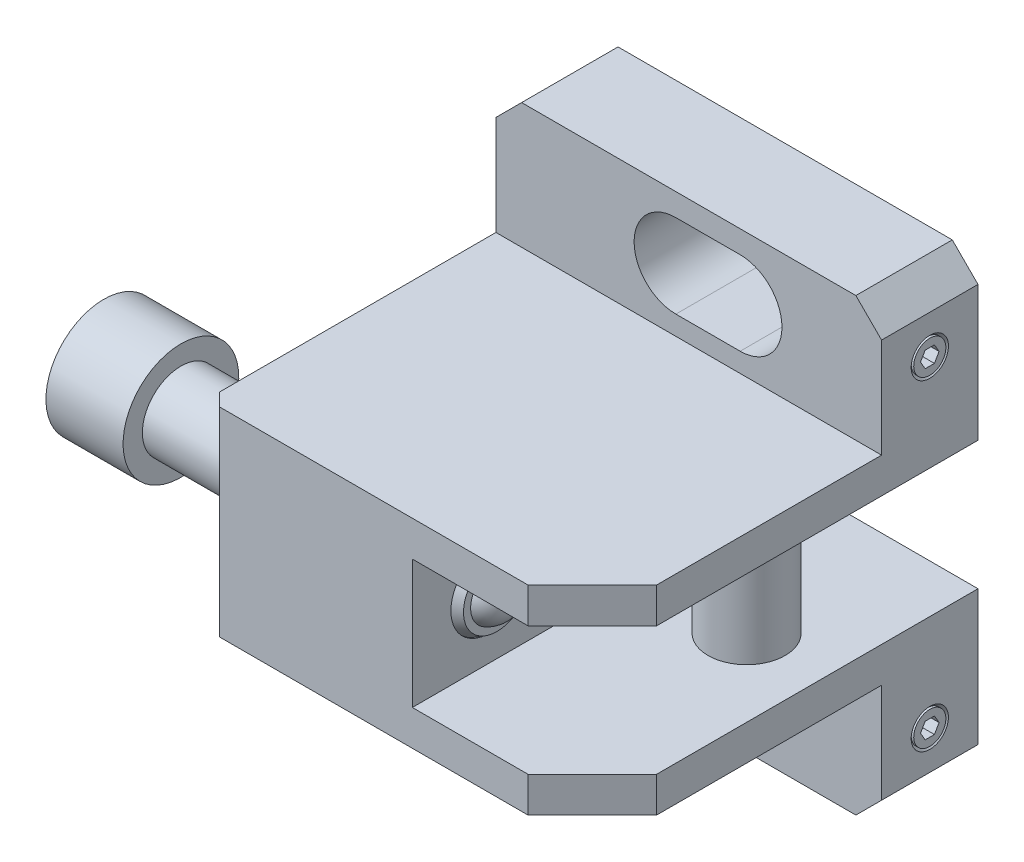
ISO-10303-21;
HEADER;
FILE_DESCRIPTION(('STEP AP214'),'2;1');
FILE_NAME('part.step','',(''),(''),'','','');
FILE_SCHEMA(('AUTOMOTIVE_DESIGN { 1 0 10303 214 1 1 1 1 }'));
ENDSEC;
DATA;
#1=APPLICATION_CONTEXT('core data for automotive mechanical design processes');
#2=APPLICATION_PROTOCOL_DEFINITION('international standard','automotive_design',2000,#1);
#3=PRODUCT_CONTEXT('',#1,'mechanical');
#4=PRODUCT('Part','Part','',(#3));
#5=PRODUCT_RELATED_PRODUCT_CATEGORY('part','',(#4));
#6=PRODUCT_DEFINITION_FORMATION('','',#4);
#7=PRODUCT_DEFINITION_CONTEXT('part definition',#1,'design');
#8=PRODUCT_DEFINITION('design','',#6,#7);
#9=PRODUCT_DEFINITION_SHAPE('','',#8);
#10=(LENGTH_UNIT() NAMED_UNIT(*) SI_UNIT(.MILLI.,.METRE.));
#11=(NAMED_UNIT(*) PLANE_ANGLE_UNIT() SI_UNIT($,.RADIAN.));
#12=(NAMED_UNIT(*) SI_UNIT($,.STERADIAN.) SOLID_ANGLE_UNIT());
#13=UNCERTAINTY_MEASURE_WITH_UNIT(LENGTH_MEASURE(1.E-05),#10,'distance_accuracy_value','');
#14=(GEOMETRIC_REPRESENTATION_CONTEXT(3) GLOBAL_UNCERTAINTY_ASSIGNED_CONTEXT((#13)) GLOBAL_UNIT_ASSIGNED_CONTEXT((#10,
#11,#12)) REPRESENTATION_CONTEXT('',''));
#15=CARTESIAN_POINT('',(0.,0.,0.));
#16=DIRECTION('',(0.,0.,1.));
#17=DIRECTION('',(1.,0.,0.));
#18=AXIS2_PLACEMENT_3D('',#15,#16,#17);
#19=CARTESIAN_POINT('',(-60.,31.6621456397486,55.4576011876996));
#20=DIRECTION('',(1.,0.,0.));
#21=DIRECTION('',(0.,0.204078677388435,0.978954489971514));
#22=AXIS2_PLACEMENT_3D('',#19,#20,#21);
#23=PLANE('',#22);
#24=DIRECTION('',(0.,0.745760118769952,-0.66621456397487));
#25=VECTOR('',#24,1.);
#26=CARTESIAN_POINT('',(-60.,30.4838968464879,49.8056048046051));
#27=LINE('',#26,#25);
#28=CARTESIAN_POINT('',(-60.,30.4838968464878,49.8056048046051));
#29=VERTEX_POINT('',#28);
#30=CARTESIAN_POINT('',(-60.,26.1782487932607,53.6519963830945));
#31=VERTEX_POINT('',#30);
#32=EDGE_CURVE('E1305',#29,#31,#27,.F.);
#33=ORIENTED_EDGE('',*,*,#32,.F.);
#34=DIRECTION('',(0.,-0.204078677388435,-0.978954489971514));
#35=VECTOR('',#34,1.);
#36=CARTESIAN_POINT('',(-60.,29.3056480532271,44.1536084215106));
#37=LINE('',#36,#35);
#38=CARTESIAN_POINT('',(-60.,29.3056480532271,44.1536084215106));
#39=VERTEX_POINT('',#38);
#40=EDGE_CURVE('E1324',#39,#29,#37,.F.);
#41=ORIENTED_EDGE('',*,*,#40,.F.);
#42=DIRECTION('',(0.,0.949838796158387,0.312739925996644));
#43=VECTOR('',#42,1.);
#44=CARTESIAN_POINT('',(-60.,29.3056480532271,44.1536084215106));
#45=LINE('',#44,#43);
#46=CARTESIAN_POINT('',(-60.,23.8217512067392,42.3480036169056));
#47=VERTEX_POINT('',#46);
#48=EDGE_CURVE('E1327',#39,#47,#45,.F.);
#49=ORIENTED_EDGE('',*,*,#48,.T.);
#50=DIRECTION('',(0.,-0.745760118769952,0.666214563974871));
#51=VECTOR('',#50,1.);
#52=CARTESIAN_POINT('',(-60.,19.5161031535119,46.194395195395));
#53=LINE('',#52,#51);
#54=CARTESIAN_POINT('',(-60.,19.5161031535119,46.194395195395));
#55=VERTEX_POINT('',#54);
#56=EDGE_CURVE('E1330',#55,#47,#53,.F.);
#57=ORIENTED_EDGE('',*,*,#56,.F.);
#58=DIRECTION('',(0.,-0.204078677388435,-0.978954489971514));
#59=VECTOR('',#58,1.);
#60=CARTESIAN_POINT('',(-60.,19.5161031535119,46.194395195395));
#61=LINE('',#60,#59);
#62=CARTESIAN_POINT('',(-60.,20.6943519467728,51.8463915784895));
#63=VERTEX_POINT('',#62);
#64=EDGE_CURVE('E1338',#55,#63,#61,.F.);
#65=ORIENTED_EDGE('',*,*,#64,.T.);
#66=DIRECTION('',(0.,-0.949838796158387,-0.312739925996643));
#67=VECTOR('',#66,1.);
#68=CARTESIAN_POINT('',(-60.,20.6943519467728,51.8463915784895));
#69=LINE('',#68,#67);
#70=EDGE_CURVE('E504',#63,#31,#69,.F.);
#71=ORIENTED_EDGE('',*,*,#70,.T.);
#72=EDGE_LOOP('',(#33,#41,#49,#57,#65,#71));
#73=FACE_BOUND('',#72,.T.);
#74=ADVANCED_FACE('F14',(#73),#23,.F.);
#75=CARTESIAN_POINT('',(-60.,29.3056480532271,44.1536084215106));
#76=DIRECTION('',(0.,0.312739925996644,-0.949838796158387));
#77=DIRECTION('',(0.,0.949838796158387,0.312739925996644));
#78=AXIS2_PLACEMENT_3D('',#75,#76,#77);
#79=PLANE('',#78);
#80=DIRECTION('',(0.,0.949838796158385,0.312739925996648));
#81=VECTOR('',#80,1.);
#82=CARTESIAN_POINT('',(-66.,23.8217512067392,42.3480036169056));
#83=LINE('',#82,#81);
#84=CARTESIAN_POINT('',(-66.,23.8217512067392,42.3480036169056));
#85=VERTEX_POINT('',#84);
#86=CARTESIAN_POINT('',(-66.,29.3056480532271,44.1536084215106));
#87=VERTEX_POINT('',#86);
#88=EDGE_CURVE('E1302',#85,#87,#83,.T.);
#89=ORIENTED_EDGE('',*,*,#88,.F.);
#90=DIRECTION('',(1.,0.,0.));
#91=VECTOR('',#90,1.);
#92=CARTESIAN_POINT('',(-60.,23.8217512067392,42.3480036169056));
#93=LINE('',#92,#91);
#94=EDGE_CURVE('E1325',#47,#85,#93,.F.);
#95=ORIENTED_EDGE('',*,*,#94,.F.);
#96=ORIENTED_EDGE('',*,*,#48,.F.);
#97=DIRECTION('',(1.,0.,0.));
#98=VECTOR('',#97,1.);
#99=CARTESIAN_POINT('',(-60.,29.3056480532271,44.1536084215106));
#100=LINE('',#99,#98);
#101=EDGE_CURVE('E1321',#87,#39,#100,.T.);
#102=ORIENTED_EDGE('',*,*,#101,.F.);
#103=EDGE_LOOP('',(#89,#95,#96,#102));
#104=FACE_BOUND('',#103,.T.);
#105=ADVANCED_FACE('F592',(#104),#79,.F.);
#106=CARTESIAN_POINT('',(-60.,19.5161031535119,46.194395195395));
#107=DIRECTION('',(0.,0.666214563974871,0.745760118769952));
#108=DIRECTION('',(0.,-0.745760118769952,0.666214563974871));
#109=AXIS2_PLACEMENT_3D('',#106,#107,#108);
#110=PLANE('',#109);
#111=DIRECTION('',(1.,0.,0.));
#112=VECTOR('',#111,1.);
#113=CARTESIAN_POINT('',(-60.,19.516103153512,46.194395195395));
#114=LINE('',#113,#112);
#115=CARTESIAN_POINT('',(-66.,19.5161031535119,46.194395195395));
#116=VERTEX_POINT('',#115);
#117=EDGE_CURVE('E1332',#116,#55,#114,.T.);
#118=ORIENTED_EDGE('',*,*,#117,.T.);
#119=ORIENTED_EDGE('',*,*,#56,.T.);
#120=ORIENTED_EDGE('',*,*,#94,.T.);
#121=DIRECTION('',(0.,0.74576011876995,-0.666214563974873));
#122=VECTOR('',#121,1.);
#123=CARTESIAN_POINT('',(-66.,19.5161031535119,46.194395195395));
#124=LINE('',#123,#122);
#125=EDGE_CURVE('E1310',#116,#85,#124,.T.);
#126=ORIENTED_EDGE('',*,*,#125,.F.);
#127=EDGE_LOOP('',(#118,#119,#120,#126));
#128=FACE_BOUND('',#127,.T.);
#129=ADVANCED_FACE('F599',(#128),#110,.T.);
#130=CARTESIAN_POINT('',(-60.,19.5161031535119,46.194395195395));
#131=DIRECTION('',(0.,-0.978954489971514,0.204078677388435));
#132=DIRECTION('',(0.,-0.204078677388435,-0.978954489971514));
#133=AXIS2_PLACEMENT_3D('',#130,#131,#132);
#134=PLANE('',#133);
#135=DIRECTION('',(0.,-0.204078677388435,-0.978954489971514));
#136=VECTOR('',#135,1.);
#137=CARTESIAN_POINT('',(-66.,20.1052275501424,49.0203933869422));
#138=LINE('',#137,#136);
#139=CARTESIAN_POINT('',(-66.,20.6943519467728,51.8463915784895));
#140=VERTEX_POINT('',#139);
#141=EDGE_CURVE('E1312',#140,#116,#138,.T.);
#142=ORIENTED_EDGE('',*,*,#141,.F.);
#143=DIRECTION('',(1.,0.,0.));
#144=VECTOR('',#143,1.);
#145=CARTESIAN_POINT('',(-60.,20.6943519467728,51.8463915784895));
#146=LINE('',#145,#144);
#147=EDGE_CURVE('E1335',#63,#140,#146,.F.);
#148=ORIENTED_EDGE('',*,*,#147,.F.);
#149=ORIENTED_EDGE('',*,*,#64,.F.);
#150=ORIENTED_EDGE('',*,*,#117,.F.);
#151=EDGE_LOOP('',(#142,#148,#149,#150));
#152=FACE_BOUND('',#151,.T.);
#153=ADVANCED_FACE('F608',(#152),#134,.F.);
#154=CARTESIAN_POINT('',(-60.,20.6943519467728,51.8463915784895));
#155=DIRECTION('',(0.,-0.312739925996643,0.949838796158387));
#156=DIRECTION('',(0.,-0.949838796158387,-0.312739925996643));
#157=AXIS2_PLACEMENT_3D('',#154,#155,#156);
#158=PLANE('',#157);
#159=DIRECTION('',(0.,-0.949838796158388,-0.312739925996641));
#160=VECTOR('',#159,1.);
#161=CARTESIAN_POINT('',(-66.,26.1782487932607,53.6519963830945));
#162=LINE('',#161,#160);
#163=CARTESIAN_POINT('',(-66.,26.1782487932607,53.6519963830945));
#164=VERTEX_POINT('',#163);
#165=EDGE_CURVE('E639',#164,#140,#162,.T.);
#166=ORIENTED_EDGE('',*,*,#165,.F.);
#167=DIRECTION('',(1.,0.,0.));
#168=VECTOR('',#167,1.);
#169=CARTESIAN_POINT('',(-60.,26.1782487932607,53.6519963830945));
#170=LINE('',#169,#168);
#171=EDGE_CURVE('E1315',#31,#164,#170,.F.);
#172=ORIENTED_EDGE('',*,*,#171,.F.);
#173=ORIENTED_EDGE('',*,*,#70,.F.);
#174=ORIENTED_EDGE('',*,*,#147,.T.);
#175=EDGE_LOOP('',(#166,#172,#173,#174));
#176=FACE_BOUND('',#175,.T.);
#177=ADVANCED_FACE('F604',(#176),#158,.F.);
#178=CARTESIAN_POINT('',(-60.,30.4838968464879,49.8056048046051));
#179=DIRECTION('',(0.,-0.666214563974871,-0.745760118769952));
#180=DIRECTION('',(0.,0.745760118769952,-0.66621456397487));
#181=AXIS2_PLACEMENT_3D('',#178,#179,#180);
#182=PLANE('',#181);
#183=DIRECTION('',(0.,-0.745760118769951,0.666214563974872));
#184=VECTOR('',#183,1.);
#185=CARTESIAN_POINT('',(-66.,30.4838968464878,49.8056048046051));
#186=LINE('',#185,#184);
#187=CARTESIAN_POINT('',(-66.,30.4838968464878,49.8056048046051));
#188=VERTEX_POINT('',#187);
#189=EDGE_CURVE('E1295',#188,#164,#186,.T.);
#190=ORIENTED_EDGE('',*,*,#189,.F.);
#191=DIRECTION('',(1.,0.,0.));
#192=VECTOR('',#191,1.);
#193=CARTESIAN_POINT('',(-60.,30.4838968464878,49.8056048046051));
#194=LINE('',#193,#192);
#195=EDGE_CURVE('E33',#188,#29,#194,.T.);
#196=ORIENTED_EDGE('',*,*,#195,.T.);
#197=ORIENTED_EDGE('',*,*,#32,.T.);
#198=ORIENTED_EDGE('',*,*,#171,.T.);
#199=EDGE_LOOP('',(#190,#196,#197,#198));
#200=FACE_BOUND('',#199,.T.);
#201=ADVANCED_FACE('F607',(#200),#182,.T.);
#202=CARTESIAN_POINT('',(-60.,29.3056480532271,44.1536084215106));
#203=DIRECTION('',(0.,-0.978954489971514,0.204078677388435));
#204=DIRECTION('',(0.,-0.204078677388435,-0.978954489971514));
#205=AXIS2_PLACEMENT_3D('',#202,#203,#204);
#206=PLANE('',#205);
#207=ORIENTED_EDGE('',*,*,#101,.T.);
#208=ORIENTED_EDGE('',*,*,#40,.T.);
#209=ORIENTED_EDGE('',*,*,#195,.F.);
#210=DIRECTION('',(0.,-0.204078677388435,-0.978954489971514));
#211=VECTOR('',#210,1.);
#212=CARTESIAN_POINT('',(-66.,29.8947724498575,46.9796066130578));
#213=LINE('',#212,#211);
#214=EDGE_CURVE('E1297',#87,#188,#213,.F.);
#215=ORIENTED_EDGE('',*,*,#214,.F.);
#216=EDGE_LOOP('',(#207,#208,#209,#215));
#217=FACE_BOUND('',#216,.T.);
#218=ADVANCED_FACE('F616',(#217),#206,.T.);
#219=CARTESIAN_POINT('',(-66.,16.1894095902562,49.8367080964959));
#220=DIRECTION('',(-1.,0.,0.));
#221=DIRECTION('',(0.,-0.204078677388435,-0.978954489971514));
#222=AXIS2_PLACEMENT_3D('',#219,#220,#221);
#223=PLANE('',#222);
#224=CARTESIAN_POINT('',(-66.,25.,48.));
#225=DIRECTION('',(1.,0.,0.));
#226=DIRECTION('',(0.,0.204078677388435,0.978954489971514));
#227=AXIS2_PLACEMENT_3D('',#224,#225,#226);
#228=CIRCLE('',#227,9.);
#229=CARTESIAN_POINT('',(-66.,26.8367080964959,56.8105904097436));
#230=VERTEX_POINT('',#229);
#231=EDGE_CURVE('E657',#230,#230,#228,.T.);
#232=ORIENTED_EDGE('',*,*,#231,.F.);
#233=EDGE_LOOP('',(#232));
#234=FACE_BOUND('',#233,.T.);
#235=ORIENTED_EDGE('',*,*,#214,.T.);
#236=ORIENTED_EDGE('',*,*,#189,.T.);
#237=ORIENTED_EDGE('',*,*,#165,.T.);
#238=ORIENTED_EDGE('',*,*,#141,.T.);
#239=ORIENTED_EDGE('',*,*,#125,.T.);
#240=ORIENTED_EDGE('',*,*,#88,.T.);
#241=EDGE_LOOP('',(#235,#236,#237,#238,#239,#240));
#242=FACE_BOUND('',#241,.T.);
#243=ADVANCED_FACE('F619',(#234,#242),#223,.T.);
#244=CARTESIAN_POINT('',(6.,25.,48.));
#245=DIRECTION('',(1.,0.,0.));
#246=DIRECTION('',(0.,0.204078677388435,0.978954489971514));
#247=AXIS2_PLACEMENT_3D('',#244,#245,#246);
#248=CYLINDRICAL_SURFACE('',#247,9.);
#249=ORIENTED_EDGE('',*,*,#231,.T.);
#250=EDGE_LOOP('',(#249));
#251=FACE_BOUND('',#250,.T.);
#252=CARTESIAN_POINT('',(-54.,25.,48.));
#253=DIRECTION('',(1.,0.,0.));
#254=DIRECTION('',(0.,0.204078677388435,0.978954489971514));
#255=AXIS2_PLACEMENT_3D('',#252,#253,#254);
#256=CIRCLE('',#255,9.);
#257=CARTESIAN_POINT('',(-54.,26.8367080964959,56.8105904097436));
#258=VERTEX_POINT('',#257);
#259=EDGE_CURVE('E649',#258,#258,#256,.T.);
#260=ORIENTED_EDGE('',*,*,#259,.F.);
#261=EDGE_LOOP('',(#260));
#262=FACE_BOUND('',#261,.T.);
#263=ADVANCED_FACE('F625',(#251,#262),#248,.T.);
#264=CARTESIAN_POINT('',(-54.,19.1262730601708,49.2244720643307));
#265=DIRECTION('',(1.,0.,0.));
#266=DIRECTION('',(0.,0.204078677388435,0.978954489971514));
#267=AXIS2_PLACEMENT_3D('',#264,#265,#266);
#268=PLANE('',#267);
#269=CARTESIAN_POINT('',(-54.,25.,48.));
#270=DIRECTION('',(1.,0.,0.));
#271=DIRECTION('',(0.,0.204078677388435,0.978954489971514));
#272=AXIS2_PLACEMENT_3D('',#269,#270,#271);
#273=CIRCLE('',#272,6.);
#274=CARTESIAN_POINT('',(-54.,26.2244720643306,53.8737269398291));
#275=VERTEX_POINT('',#274);
#276=EDGE_CURVE('E643',#275,#275,#273,.T.);
#277=ORIENTED_EDGE('',*,*,#276,.F.);
#278=EDGE_LOOP('',(#277));
#279=FACE_BOUND('',#278,.T.);
#280=ORIENTED_EDGE('',*,*,#259,.T.);
#281=EDGE_LOOP('',(#280));
#282=FACE_BOUND('',#281,.T.);
#283=ADVANCED_FACE('F663',(#279,#282),#268,.T.);
#284=CARTESIAN_POINT('',(6.,25.,48.));
#285=DIRECTION('',(1.,0.,0.));
#286=DIRECTION('',(0.,0.204078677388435,0.978954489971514));
#287=AXIS2_PLACEMENT_3D('',#284,#285,#286);
#288=CYLINDRICAL_SURFACE('',#287,6.);
#289=ORIENTED_EDGE('',*,*,#276,.T.);
#290=EDGE_LOOP('',(#289));
#291=FACE_BOUND('',#290,.T.);
#292=CARTESIAN_POINT('',(-38.,25.,48.));
#293=DIRECTION('',(1.,0.,0.));
#294=DIRECTION('',(0.,0.,-1.));
#295=AXIS2_PLACEMENT_3D('',#292,#293,#294);
#296=CIRCLE('',#295,6.);
#297=CARTESIAN_POINT('',(-38.,25.,42.));
#298=VERTEX_POINT('',#297);
#299=EDGE_CURVE('E9',#298,#298,#296,.F.);
#300=ORIENTED_EDGE('',*,*,#299,.T.);
#301=EDGE_LOOP('',(#300));
#302=FACE_BOUND('',#301,.T.);
#303=ADVANCED_FACE('F590',(#291,#302),#288,.T.);
#304=CARTESIAN_POINT('',(-6.35,25.,48.));
#305=DIRECTION('',(0.,-0.978954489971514,0.204078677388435));
#306=DIRECTION('',(-1.,0.,0.));
#307=AXIS2_PLACEMENT_3D('',#304,#305,#306);
#308=SPHERICAL_SURFACE('',#307,4.35);
#309=CARTESIAN_POINT('',(-4.85,21.002735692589,48.8332934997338));
#310=CARTESIAN_POINT('',(-4.85,20.9793400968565,48.7210627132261));
#311=CARTESIAN_POINT('',(-4.85,20.9606697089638,48.607825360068));
#312=CARTESIAN_POINT('',(-4.85,20.9329202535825,48.3801606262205));
#313=CARTESIAN_POINT('',(-4.85,20.9238440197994,48.2657329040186));
#314=CARTESIAN_POINT('',(-4.85,20.9153496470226,48.0363266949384));
#315=CARTESIAN_POINT('',(-4.85,20.9159468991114,47.9213476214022));
#316=CARTESIAN_POINT('',(-4.85,20.9268272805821,47.6917842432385));
#317=CARTESIAN_POINT('',(-4.85,20.937118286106,47.577200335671));
#318=CARTESIAN_POINT('',(-4.85,20.9824158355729,47.2357514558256));
#319=CARTESIAN_POINT('',(-4.85,21.0318269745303,47.0106347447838));
#320=CARTESIAN_POINT('',(-4.85,21.167795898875,46.5719044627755));
#321=CARTESIAN_POINT('',(-4.85,21.2543550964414,46.3582913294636));
#322=CARTESIAN_POINT('',(-4.85,21.4100424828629,46.0511684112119));
#323=CARTESIAN_POINT('',(-4.85,21.4662916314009,45.9509490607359));
#324=CARTESIAN_POINT('',(-4.85,21.5869882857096,45.7556746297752));
#325=CARTESIAN_POINT('',(-4.85,21.6514278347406,45.660614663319));
#326=CARTESIAN_POINT('',(-4.85,21.7881107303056,45.4762232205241));
#327=CARTESIAN_POINT('',(-4.85,21.8603575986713,45.3868943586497));
#328=CARTESIAN_POINT('',(-4.85,22.012135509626,45.2146188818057));
#329=CARTESIAN_POINT('',(-4.85,22.0916682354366,45.1316737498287));
#330=CARTESIAN_POINT('',(-4.85,22.2574191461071,44.9728036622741));
#331=CARTESIAN_POINT('',(-4.85,22.3436350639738,44.8968763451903));
#332=CARTESIAN_POINT('',(-4.85,22.5221591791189,44.7525385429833));
#333=CARTESIAN_POINT('',(-4.85,22.6144696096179,44.6841308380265));
#334=CARTESIAN_POINT('',(-4.85,22.8995134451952,44.4910116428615));
#335=CARTESIAN_POINT('',(-4.85,23.1005414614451,44.3782298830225));
#336=CARTESIAN_POINT('',(-4.85,23.5185820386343,44.1880850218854));
#337=CARTESIAN_POINT('',(-4.85,23.7355946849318,44.1107221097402));
#338=CARTESIAN_POINT('',(-4.85,24.1795235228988,43.9935025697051));
#339=CARTESIAN_POINT('',(-4.85,24.4064397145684,43.9536459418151));
#340=CARTESIAN_POINT('',(-4.85,24.863856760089,43.9126259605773));
#341=CARTESIAN_POINT('',(-4.85,25.0943575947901,43.9114624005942));
#342=CARTESIAN_POINT('',(-4.85000000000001,25.4375832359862,43.9386868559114));
#343=CARTESIAN_POINT('',(-4.85000000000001,25.551631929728,43.9526053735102));
#344=CARTESIAN_POINT('',(-4.85,25.778140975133,43.9899940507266));
#345=CARTESIAN_POINT('',(-4.85,25.89060189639,44.0134606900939));
#346=CARTESIAN_POINT('',(-4.85,26.1131771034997,44.0697931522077));
#347=CARTESIAN_POINT('',(-4.85000000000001,26.2232905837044,44.1026621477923));
#348=CARTESIAN_POINT('',(-4.85000000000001,26.4403322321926,44.1775507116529));
#349=CARTESIAN_POINT('',(-4.85000000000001,26.5472611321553,44.2195681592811));
#350=CARTESIAN_POINT('',(-4.85000000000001,26.7571569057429,44.3124454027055));
#351=CARTESIAN_POINT('',(-4.85000000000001,26.8601255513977,44.3633011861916));
#352=CARTESIAN_POINT('',(-4.85000000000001,27.0614917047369,44.4735348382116));
#353=CARTESIAN_POINT('',(-4.85,27.1598847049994,44.5329208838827));
#354=CARTESIAN_POINT('',(-4.85,27.4468976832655,44.7231486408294));
#355=CARTESIAN_POINT('',(-4.85000000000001,27.627629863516,44.8661834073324));
#356=CARTESIAN_POINT('',(-4.85000000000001,27.962466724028,45.1805972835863));
#357=CARTESIAN_POINT('',(-4.85,28.1165724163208,45.3519753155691));
#358=CARTESIAN_POINT('',(-4.85,28.3245316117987,45.6265516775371));
#359=CARTESIAN_POINT('',(-4.85000000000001,28.3900488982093,45.7211183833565));
#360=CARTESIAN_POINT('',(-4.85000000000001,28.5128417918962,45.9153852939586));
#361=CARTESIAN_POINT('',(-4.85000000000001,28.570124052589,46.0150812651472));
#362=CARTESIAN_POINT('',(-4.85000000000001,28.6759902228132,46.2187764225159));
#363=CARTESIAN_POINT('',(-4.85000000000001,28.7245878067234,46.3227685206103));
#364=CARTESIAN_POINT('',(-4.85000000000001,28.8128491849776,46.5344550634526));
#365=CARTESIAN_POINT('',(-4.85,28.8525156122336,46.6421484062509));
#366=CARTESIAN_POINT('',(-4.85,28.9094866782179,46.8195125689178));
#367=CARTESIAN_POINT('',(-4.85,28.9295985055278,46.8882951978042));
#368=CARTESIAN_POINT('',(-4.85000000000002,28.966176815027,47.0268230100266));
#369=CARTESIAN_POINT('',(-4.85000000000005,28.9826432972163,47.0965681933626));
#370=CARTESIAN_POINT('',(-4.85000000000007,29.0206599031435,47.278937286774));
#371=CARTESIAN_POINT('',(-4.85000000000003,29.0393302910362,47.3921746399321));
#372=CARTESIAN_POINT('',(-4.84999999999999,29.0670797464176,47.6198393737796));
#373=CARTESIAN_POINT('',(-4.85,29.0761559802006,47.7342670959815));
#374=CARTESIAN_POINT('',(-4.85000000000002,29.0846503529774,47.9636733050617));
#375=CARTESIAN_POINT('',(-4.85000000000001,29.0840531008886,48.0786523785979));
#376=CARTESIAN_POINT('',(-4.85000000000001,29.0731727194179,48.3082157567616));
#377=CARTESIAN_POINT('',(-4.85,29.062881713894,48.4227996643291));
#378=CARTESIAN_POINT('',(-4.85,29.0175841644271,48.7642485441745));
#379=CARTESIAN_POINT('',(-4.85000000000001,28.9681730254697,48.9893652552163));
#380=CARTESIAN_POINT('',(-4.85000000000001,28.832204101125,49.4280955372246));
#381=CARTESIAN_POINT('',(-4.85,28.7456449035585,49.6417086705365));
#382=CARTESIAN_POINT('',(-4.85,28.5899575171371,49.9488315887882));
#383=CARTESIAN_POINT('',(-4.85000000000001,28.533708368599,50.0490509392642));
#384=CARTESIAN_POINT('',(-4.85000000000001,28.4130117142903,50.2443253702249));
#385=CARTESIAN_POINT('',(-4.85000000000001,28.3485721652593,50.3393853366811));
#386=CARTESIAN_POINT('',(-4.85000000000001,28.2118892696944,50.523776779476));
#387=CARTESIAN_POINT('',(-4.85000000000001,28.1396424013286,50.6131056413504));
#388=CARTESIAN_POINT('',(-4.85000000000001,27.9878644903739,50.7853811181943));
#389=CARTESIAN_POINT('',(-4.85,27.9083317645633,50.8683262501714));
#390=CARTESIAN_POINT('',(-4.85,27.7425808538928,51.0271963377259));
#391=CARTESIAN_POINT('',(-4.85000000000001,27.6563649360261,51.1031236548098));
#392=CARTESIAN_POINT('',(-4.85000000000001,27.477840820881,51.2474614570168));
#393=CARTESIAN_POINT('',(-4.85000000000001,27.385530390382,51.3158691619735));
#394=CARTESIAN_POINT('',(-4.85,27.1004865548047,51.5089883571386));
#395=CARTESIAN_POINT('',(-4.85,26.8994585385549,51.6217701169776));
#396=CARTESIAN_POINT('',(-4.85,26.4814179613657,51.8119149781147));
#397=CARTESIAN_POINT('',(-4.85000000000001,26.2644053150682,51.8892778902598));
#398=CARTESIAN_POINT('',(-4.85000000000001,25.8204764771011,52.0064974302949));
#399=CARTESIAN_POINT('',(-4.85,25.5935602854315,52.0463540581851));
#400=CARTESIAN_POINT('',(-4.85,25.1361432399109,52.0873740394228));
#401=CARTESIAN_POINT('',(-4.85,24.9056424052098,52.0885375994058));
#402=CARTESIAN_POINT('',(-4.85000000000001,24.5624167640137,52.0613131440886));
#403=CARTESIAN_POINT('',(-4.85000000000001,24.4483680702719,52.0473946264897));
#404=CARTESIAN_POINT('',(-4.85,24.2218590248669,52.0100059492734));
#405=CARTESIAN_POINT('',(-4.85,24.10939810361,51.9865393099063));
#406=CARTESIAN_POINT('',(-4.85,23.8868228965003,51.9302068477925));
#407=CARTESIAN_POINT('',(-4.85,23.7767094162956,51.8973378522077));
#408=CARTESIAN_POINT('',(-4.85,23.5596677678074,51.822449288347));
#409=CARTESIAN_POINT('',(-4.85,23.4527388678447,51.7804318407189));
#410=CARTESIAN_POINT('',(-4.85,23.2428430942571,51.6875545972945));
#411=CARTESIAN_POINT('',(-4.85,23.1398744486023,51.6366988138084));
#412=CARTESIAN_POINT('',(-4.85,22.938508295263,51.5264651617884));
#413=CARTESIAN_POINT('',(-4.85,22.8401152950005,51.4670791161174));
#414=CARTESIAN_POINT('',(-4.85,22.5531023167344,51.2768513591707));
#415=CARTESIAN_POINT('',(-4.85,22.372370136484,51.1338165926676));
#416=CARTESIAN_POINT('',(-4.85,22.037533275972,50.8194027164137));
#417=CARTESIAN_POINT('',(-4.85,21.8834275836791,50.648024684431));
#418=CARTESIAN_POINT('',(-4.85,21.6754683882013,50.373448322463));
#419=CARTESIAN_POINT('',(-4.85,21.6099511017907,50.2788816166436));
#420=CARTESIAN_POINT('',(-4.85,21.4871582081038,50.0846147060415));
#421=CARTESIAN_POINT('',(-4.85,21.4298759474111,49.9849187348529));
#422=CARTESIAN_POINT('',(-4.85,21.3240097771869,49.7812235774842));
#423=CARTESIAN_POINT('',(-4.85,21.2754121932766,49.6772314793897));
#424=CARTESIAN_POINT('',(-4.85,21.1871508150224,49.4655449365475));
#425=CARTESIAN_POINT('',(-4.85,21.1474843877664,49.3578515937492));
#426=CARTESIAN_POINT('',(-4.85,21.0905133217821,49.1804874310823));
#427=CARTESIAN_POINT('',(-4.85,21.0704014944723,49.1117048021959));
#428=CARTESIAN_POINT('',(-4.85,21.0338231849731,48.9731769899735));
#429=CARTESIAN_POINT('',(-4.85,21.0173567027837,48.9034318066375));
#430=CARTESIAN_POINT('',(-4.85,21.002735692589,48.8332934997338));
#431=B_SPLINE_CURVE_WITH_KNOTS('',3,(#309,#310,#311,#312,#313,#314,#315,#316,#317,#318,#319,
#320,#321,#322,#323,#324,#325,#326,#327,#328,#329,#330,#331,#332,#333,#334,#335,#336,#337,#338,
#339,#340,#341,#342,#343,#344,#345,#346,#347,#348,#349,#350,#351,#352,#353,#354,#355,#356,#357,
#358,#359,#360,#361,#362,#363,#364,#365,#366,#367,#368,#369,#370,#371,#372,#373,#374,#375,#376,
#377,#378,#379,#380,#381,#382,#383,#384,#385,#386,#387,#388,#389,#390,#391,#392,#393,#394,#395,
#396,#397,#398,#399,#400,#401,#402,#403,#404,#405,#406,#407,#408,#409,#410,#411,#412,#413,#414,
#415,#416,#417,#418,#419,#420,#421,#422,#423,#424,#425,#426,#427,#428,#429,#430),.UNSPECIFIED.,
.T.,.F.,(4,2,2,2,2,2,2,2,2,2,2,2,2,2,2,2,2,2,2,2,2,2,2,2,2,2,2,2,2,2,2,2,2,2,2,2,2,2,2,2,2,2,2,
2,2,2,2,2,2,2,2,2,2,2,2,2,2,2,2,2,4),(0.,0.343864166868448,0.687829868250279,1.03234289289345,
1.37713607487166,2.06507885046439,2.75304778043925,3.09748299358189,3.44158611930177,
3.78584512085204,4.13018385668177,4.47440629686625,4.81875557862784,5.5067077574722,
6.19466361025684,6.88261946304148,7.57057164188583,7.91492092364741,8.25914336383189,
8.60348209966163,8.9477411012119,9.29184422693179,9.63627944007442,10.3242483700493,
11.012191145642,11.3569843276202,11.7014973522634,12.0454630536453,12.3893272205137,
12.6042241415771,12.8191210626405,13.162985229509,13.5069509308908,13.851463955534,
14.1962571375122,14.884199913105,15.5721688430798,15.9166040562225,16.2607071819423,
16.6049661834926,16.9493049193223,17.2935273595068,17.6378766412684,18.3258288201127,
19.0137846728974,19.701740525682,20.3896927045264,20.734041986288,21.0782644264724,
21.4226031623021,21.7668621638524,22.1109652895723,22.4554005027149,23.1433694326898,
23.8313122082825,24.1761053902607,24.5206184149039,24.8645841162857,25.2084482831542,
25.4233452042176,25.638242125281),.UNSPECIFIED.);
#432=CARTESIAN_POINT('',(-4.85,21.002735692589,48.8332934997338));
#433=VERTEX_POINT('',#432);
#434=EDGE_CURVE('E651',#433,#433,#431,.T.);
#435=ORIENTED_EDGE('',*,*,#434,.T.);
#436=EDGE_LOOP('',(#435));
#437=FACE_BOUND('',#436,.T.);
#438=ADVANCED_FACE('F627',(#437),#308,.T.);
#439=CARTESIAN_POINT('',(-4.85,19.9175525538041,49.0595172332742));
#440=DIRECTION('',(-1.,0.,0.));
#441=DIRECTION('',(0.,-0.204078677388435,-0.978954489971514));
#442=AXIS2_PLACEMENT_3D('',#439,#440,#441);
#443=PLANE('',#442);
#444=CARTESIAN_POINT('',(-4.85000000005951,25.,48.));
#445=DIRECTION('',(-1.,0.,0.));
#446=DIRECTION('',(0.,-0.204078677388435,-0.978954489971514));
#447=AXIS2_PLACEMENT_3D('',#444,#445,#446);
#448=CIRCLE('',#447,5.1917096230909);
#449=CARTESIAN_POINT('',(-4.85000000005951,23.9404827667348,42.9175525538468));
#450=VERTEX_POINT('',#449);
#451=EDGE_CURVE('E646',#450,#450,#448,.T.);
#452=ORIENTED_EDGE('',*,*,#451,.F.);
#453=EDGE_LOOP('',(#452));
#454=FACE_BOUND('',#453,.T.);
#455=ORIENTED_EDGE('',*,*,#434,.F.);
#456=EDGE_LOOP('',(#455));
#457=FACE_BOUND('',#456,.T.);
#458=ADVANCED_FACE('F632',(#454,#457),#443,.F.);
#459=CARTESIAN_POINT('',(-6.25000000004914,25.,48.));
#460=DIRECTION('',(-1.,0.,0.));
#461=DIRECTION('',(0.,-0.204078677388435,-0.978954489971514));
#462=AXIS2_PLACEMENT_3D('',#459,#460,#461);
#463=CONICAL_SURFACE('',#462,5.99999999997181,0.523598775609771);
#464=CARTESIAN_POINT('',(-6.25,25.,48.));
#465=DIRECTION('',(1.,0.,0.));
#466=DIRECTION('',(0.,0.204078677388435,0.978954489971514));
#467=AXIS2_PLACEMENT_3D('',#464,#465,#466);
#468=CIRCLE('',#467,6.);
#469=CARTESIAN_POINT('',(-6.25,26.2244720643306,53.8737269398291));
#470=VERTEX_POINT('',#469);
#471=EDGE_CURVE('E24',#470,#470,#468,.F.);
#472=ORIENTED_EDGE('',*,*,#471,.F.);
#473=EDGE_LOOP('',(#472));
#474=FACE_BOUND('',#473,.T.);
#475=ORIENTED_EDGE('',*,*,#451,.T.);
#476=EDGE_LOOP('',(#475));
#477=FACE_BOUND('',#476,.T.);
#478=ADVANCED_FACE('F661',(#474,#477),#463,.T.);
#479=CARTESIAN_POINT('',(20.,52.5,7.5));
#480=DIRECTION('',(1.,0.,0.));
#481=DIRECTION('',(0.,1.,0.));
#482=AXIS2_PLACEMENT_3D('',#479,#480,#481);
#483=PLANE('',#482);
#484=DIRECTION('',(0.,0.866025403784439,0.5));
#485=VECTOR('',#484,1.);
#486=CARTESIAN_POINT('',(20.,50.,6.05662432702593));
#487=LINE('',#486,#485);
#488=CARTESIAN_POINT('',(20.,50.,6.05662432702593));
#489=VERTEX_POINT('',#488);
#490=CARTESIAN_POINT('',(20.,51.25,6.77831216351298));
#491=VERTEX_POINT('',#490);
#492=EDGE_CURVE('E1465',#489,#491,#487,.T.);
#493=ORIENTED_EDGE('',*,*,#492,.T.);
#494=DIRECTION('',(0.,0.,1.));
#495=VECTOR('',#494,1.);
#496=CARTESIAN_POINT('',(20.,51.25,7.5));
#497=LINE('',#496,#495);
#498=CARTESIAN_POINT('',(20.,51.25,8.22168783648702));
#499=VERTEX_POINT('',#498);
#500=EDGE_CURVE('E1386',#491,#499,#497,.T.);
#501=ORIENTED_EDGE('',*,*,#500,.T.);
#502=DIRECTION('',(0.,0.866025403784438,-0.5));
#503=VECTOR('',#502,1.);
#504=CARTESIAN_POINT('',(20.,50.,8.94337567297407));
#505=LINE('',#504,#503);
#506=CARTESIAN_POINT('',(20.,50.,8.94337567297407));
#507=VERTEX_POINT('',#506);
#508=EDGE_CURVE('E1402',#507,#499,#505,.T.);
#509=ORIENTED_EDGE('',*,*,#508,.F.);
#510=DIRECTION('',(0.,-0.866025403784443,-0.499999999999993));
#511=VECTOR('',#510,1.);
#512=CARTESIAN_POINT('',(20.,50.,8.94337567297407));
#513=LINE('',#512,#511);
#514=CARTESIAN_POINT('',(20.,48.75,8.22168783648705));
#515=VERTEX_POINT('',#514);
#516=EDGE_CURVE('E1389',#507,#515,#513,.T.);
#517=ORIENTED_EDGE('',*,*,#516,.T.);
#518=DIRECTION('',(0.,0.,-1.));
#519=VECTOR('',#518,1.);
#520=CARTESIAN_POINT('',(20.,48.75,8.22168783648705));
#521=LINE('',#520,#519);
#522=CARTESIAN_POINT('',(20.,48.75,6.77831216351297));
#523=VERTEX_POINT('',#522);
#524=EDGE_CURVE('E1446',#515,#523,#521,.T.);
#525=ORIENTED_EDGE('',*,*,#524,.T.);
#526=DIRECTION('',(0.,-0.866025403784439,0.5));
#527=VECTOR('',#526,1.);
#528=CARTESIAN_POINT('',(20.,50.,6.05662432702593));
#529=LINE('',#528,#527);
#530=EDGE_CURVE('E1463',#489,#523,#529,.T.);
#531=ORIENTED_EDGE('',*,*,#530,.F.);
#532=EDGE_LOOP('',(#493,#501,#509,#517,#525,#531));
#533=FACE_BOUND('',#532,.T.);
#534=ADVANCED_FACE('F669',(#533),#483,.T.);
#535=CARTESIAN_POINT('',(20.,2.5,7.5));
#536=DIRECTION('',(1.,0.,0.));
#537=DIRECTION('',(0.,1.,0.));
#538=AXIS2_PLACEMENT_3D('',#535,#536,#537);
#539=PLANE('',#538);
#540=DIRECTION('',(0.,0.866025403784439,0.5));
#541=VECTOR('',#540,1.);
#542=CARTESIAN_POINT('',(20.,0.,6.05662432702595));
#543=LINE('',#542,#541);
#544=CARTESIAN_POINT('',(20.,0.,6.05662432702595));
#545=VERTEX_POINT('',#544);
#546=CARTESIAN_POINT('',(20.,1.25,6.77831216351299));
#547=VERTEX_POINT('',#546);
#548=EDGE_CURVE('E1415',#545,#547,#543,.T.);
#549=ORIENTED_EDGE('',*,*,#548,.T.);
#550=DIRECTION('',(0.,0.,1.));
#551=VECTOR('',#550,1.);
#552=CARTESIAN_POINT('',(20.,1.25,7.5));
#553=LINE('',#552,#551);
#554=CARTESIAN_POINT('',(20.,1.25,8.22168783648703));
#555=VERTEX_POINT('',#554);
#556=EDGE_CURVE('E1384',#547,#555,#553,.T.);
#557=ORIENTED_EDGE('',*,*,#556,.T.);
#558=DIRECTION('',(0.,0.866025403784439,-0.5));
#559=VECTOR('',#558,1.);
#560=CARTESIAN_POINT('',(20.,0.,8.94337567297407));
#561=LINE('',#560,#559);
#562=CARTESIAN_POINT('',(20.,0.,8.94337567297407));
#563=VERTEX_POINT('',#562);
#564=EDGE_CURVE('E397',#563,#555,#561,.T.);
#565=ORIENTED_EDGE('',*,*,#564,.F.);
#566=DIRECTION('',(0.,-0.866025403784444,-0.499999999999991));
#567=VECTOR('',#566,1.);
#568=CARTESIAN_POINT('',(20.,0.,8.94337567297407));
#569=LINE('',#568,#567);
#570=CARTESIAN_POINT('',(20.,-1.25,8.22168783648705));
#571=VERTEX_POINT('',#570);
#572=EDGE_CURVE('E1395',#563,#571,#569,.T.);
#573=ORIENTED_EDGE('',*,*,#572,.T.);
#574=DIRECTION('',(0.,0.,1.));
#575=VECTOR('',#574,1.);
#576=CARTESIAN_POINT('',(20.,-1.25,8.22168783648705));
#577=LINE('',#576,#575);
#578=CARTESIAN_POINT('',(20.,-1.25,6.77831216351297));
#579=VERTEX_POINT('',#578);
#580=EDGE_CURVE('E1434',#571,#579,#577,.F.);
#581=ORIENTED_EDGE('',*,*,#580,.T.);
#582=DIRECTION('',(0.,-0.86602540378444,0.5));
#583=VECTOR('',#582,1.);
#584=CARTESIAN_POINT('',(20.,0.,6.05662432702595));
#585=LINE('',#584,#583);
#586=EDGE_CURVE('E1417',#545,#579,#585,.T.);
#587=ORIENTED_EDGE('',*,*,#586,.F.);
#588=EDGE_LOOP('',(#549,#557,#565,#573,#581,#587));
#589=FACE_BOUND('',#588,.T.);
#590=ADVANCED_FACE('F712',(#589),#539,.T.);
#591=CARTESIAN_POINT('',(20.,50.,8.94337567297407));
#592=DIRECTION('',(0.,-0.5,-0.866025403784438));
#593=DIRECTION('',(0.,0.866025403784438,-0.5));
#594=AXIS2_PLACEMENT_3D('',#591,#592,#593);
#595=PLANE('',#594);
#596=DIRECTION('',(1.,0.,0.));
#597=VECTOR('',#596,1.);
#598=CARTESIAN_POINT('',(20.,50.,8.94337567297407));
#599=LINE('',#598,#597);
#600=CARTESIAN_POINT('',(22.,50.,8.94337567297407));
#601=VERTEX_POINT('',#600);
#602=EDGE_CURVE('E1406',#601,#507,#599,.F.);
#603=ORIENTED_EDGE('',*,*,#602,.T.);
#604=ORIENTED_EDGE('',*,*,#508,.T.);
#605=DIRECTION('',(1.,0.,0.));
#606=VECTOR('',#605,1.);
#607=CARTESIAN_POINT('',(20.,51.25,8.22168783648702));
#608=LINE('',#607,#606);
#609=CARTESIAN_POINT('',(22.,51.25,8.22168783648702));
#610=VERTEX_POINT('',#609);
#611=EDGE_CURVE('E1399',#499,#610,#608,.T.);
#612=ORIENTED_EDGE('',*,*,#611,.T.);
#613=DIRECTION('',(0.,-0.866025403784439,0.5));
#614=VECTOR('',#613,1.);
#615=CARTESIAN_POINT('',(22.,51.25,8.22168783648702));
#616=LINE('',#615,#614);
#617=EDGE_CURVE('E390',#610,#601,#616,.T.);
#618=ORIENTED_EDGE('',*,*,#617,.T.);
#619=EDGE_LOOP('',(#603,#604,#612,#618));
#620=FACE_BOUND('',#619,.T.);
#621=ADVANCED_FACE('F708',(#620),#595,.T.);
#622=CARTESIAN_POINT('',(20.,50.,8.94337567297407));
#623=DIRECTION('',(0.,-0.499999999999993,0.866025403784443));
#624=DIRECTION('',(0.,-0.866025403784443,-0.499999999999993));
#625=AXIS2_PLACEMENT_3D('',#622,#623,#624);
#626=PLANE('',#625);
#627=ORIENTED_EDGE('',*,*,#602,.F.);
#628=DIRECTION('',(0.,-0.866025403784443,-0.499999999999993));
#629=VECTOR('',#628,1.);
#630=CARTESIAN_POINT('',(22.,50.,8.94337567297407));
#631=LINE('',#630,#629);
#632=CARTESIAN_POINT('',(22.,48.75,8.22168783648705));
#633=VERTEX_POINT('',#632);
#634=EDGE_CURVE('E1441',#633,#601,#631,.F.);
#635=ORIENTED_EDGE('',*,*,#634,.F.);
#636=DIRECTION('',(1.,0.,0.));
#637=VECTOR('',#636,1.);
#638=CARTESIAN_POINT('',(20.,48.75,8.22168783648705));
#639=LINE('',#638,#637);
#640=EDGE_CURVE('E1438',#515,#633,#639,.T.);
#641=ORIENTED_EDGE('',*,*,#640,.F.);
#642=ORIENTED_EDGE('',*,*,#516,.F.);
#643=EDGE_LOOP('',(#627,#635,#641,#642));
#644=FACE_BOUND('',#643,.T.);
#645=ADVANCED_FACE('F692',(#644),#626,.F.);
#646=CARTESIAN_POINT('',(20.,48.75,8.22168783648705));
#647=DIRECTION('',(0.,-1.,0.));
#648=DIRECTION('',(0.,0.,-1.));
#649=AXIS2_PLACEMENT_3D('',#646,#647,#648);
#650=PLANE('',#649);
#651=DIRECTION('',(0.,0.,-1.));
#652=VECTOR('',#651,1.);
#653=CARTESIAN_POINT('',(22.,48.75,8.22168783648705));
#654=LINE('',#653,#652);
#655=CARTESIAN_POINT('',(22.,48.75,6.77831216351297));
#656=VERTEX_POINT('',#655);
#657=EDGE_CURVE('E1420',#656,#633,#654,.F.);
#658=ORIENTED_EDGE('',*,*,#657,.F.);
#659=DIRECTION('',(1.,0.,0.));
#660=VECTOR('',#659,1.);
#661=CARTESIAN_POINT('',(20.,48.75,6.77831216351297));
#662=LINE('',#661,#660);
#663=EDGE_CURVE('E1424',#523,#656,#662,.T.);
#664=ORIENTED_EDGE('',*,*,#663,.F.);
#665=ORIENTED_EDGE('',*,*,#524,.F.);
#666=ORIENTED_EDGE('',*,*,#640,.T.);
#667=EDGE_LOOP('',(#658,#664,#665,#666));
#668=FACE_BOUND('',#667,.T.);
#669=ADVANCED_FACE('F678',(#668),#650,.F.);
#670=CARTESIAN_POINT('',(20.,50.,6.05662432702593));
#671=DIRECTION('',(0.,0.5,0.866025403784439));
#672=DIRECTION('',(0.,-0.866025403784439,0.5));
#673=AXIS2_PLACEMENT_3D('',#670,#671,#672);
#674=PLANE('',#673);
#675=DIRECTION('',(1.,0.,0.));
#676=VECTOR('',#675,1.);
#677=CARTESIAN_POINT('',(20.,50.,6.05662432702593));
#678=LINE('',#677,#676);
#679=CARTESIAN_POINT('',(22.,50.,6.05662432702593));
#680=VERTEX_POINT('',#679);
#681=EDGE_CURVE('E1454',#680,#489,#678,.F.);
#682=ORIENTED_EDGE('',*,*,#681,.T.);
#683=ORIENTED_EDGE('',*,*,#530,.T.);
#684=ORIENTED_EDGE('',*,*,#663,.T.);
#685=DIRECTION('',(0.,-0.866025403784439,0.5));
#686=VECTOR('',#685,1.);
#687=CARTESIAN_POINT('',(22.,50.,6.05662432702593));
#688=LINE('',#687,#686);
#689=EDGE_CURVE('E1467',#656,#680,#688,.F.);
#690=ORIENTED_EDGE('',*,*,#689,.T.);
#691=EDGE_LOOP('',(#682,#683,#684,#690));
#692=FACE_BOUND('',#691,.T.);
#693=ADVANCED_FACE('F671',(#692),#674,.T.);
#694=CARTESIAN_POINT('',(20.,50.,6.05662432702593));
#695=DIRECTION('',(0.,0.5,-0.866025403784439));
#696=DIRECTION('',(0.,0.866025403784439,0.5));
#697=AXIS2_PLACEMENT_3D('',#694,#695,#696);
#698=PLANE('',#697);
#699=DIRECTION('',(0.,0.866025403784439,0.5));
#700=VECTOR('',#699,1.);
#701=CARTESIAN_POINT('',(22.,50.,6.05662432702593));
#702=LINE('',#701,#700);
#703=CARTESIAN_POINT('',(22.,51.25,6.77831216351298));
#704=VERTEX_POINT('',#703);
#705=EDGE_CURVE('E1458',#704,#680,#702,.F.);
#706=ORIENTED_EDGE('',*,*,#705,.F.);
#707=DIRECTION('',(1.,0.,0.));
#708=VECTOR('',#707,1.);
#709=CARTESIAN_POINT('',(20.,51.25,6.77831216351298));
#710=LINE('',#709,#708);
#711=EDGE_CURVE('E1430',#491,#704,#710,.T.);
#712=ORIENTED_EDGE('',*,*,#711,.F.);
#713=ORIENTED_EDGE('',*,*,#492,.F.);
#714=ORIENTED_EDGE('',*,*,#681,.F.);
#715=EDGE_LOOP('',(#706,#712,#713,#714));
#716=FACE_BOUND('',#715,.T.);
#717=ADVANCED_FACE('F677',(#716),#698,.F.);
#718=CARTESIAN_POINT('',(20.,51.25,8.22168783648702));
#719=DIRECTION('',(0.,-1.,0.));
#720=DIRECTION('',(0.,0.,-1.));
#721=AXIS2_PLACEMENT_3D('',#718,#719,#720);
#722=PLANE('',#721);
#723=ORIENTED_EDGE('',*,*,#611,.F.);
#724=ORIENTED_EDGE('',*,*,#500,.F.);
#725=ORIENTED_EDGE('',*,*,#711,.T.);
#726=DIRECTION('',(0.,0.,-1.));
#727=VECTOR('',#726,1.);
#728=CARTESIAN_POINT('',(22.,51.25,8.22168783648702));
#729=LINE('',#728,#727);
#730=EDGE_CURVE('E1436',#704,#610,#729,.F.);
#731=ORIENTED_EDGE('',*,*,#730,.T.);
#732=EDGE_LOOP('',(#723,#724,#725,#731));
#733=FACE_BOUND('',#732,.T.);
#734=ADVANCED_FACE('F688',(#733),#722,.T.);
#735=CARTESIAN_POINT('',(20.,0.,8.94337567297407));
#736=DIRECTION('',(0.,-0.5,-0.866025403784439));
#737=DIRECTION('',(0.,0.866025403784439,-0.5));
#738=AXIS2_PLACEMENT_3D('',#735,#736,#737);
#739=PLANE('',#738);
#740=DIRECTION('',(1.,0.,0.));
#741=VECTOR('',#740,1.);
#742=CARTESIAN_POINT('',(20.,0.,8.94337567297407));
#743=LINE('',#742,#741);
#744=CARTESIAN_POINT('',(22.,0.,8.94337567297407));
#745=VERTEX_POINT('',#744);
#746=EDGE_CURVE('E1413',#745,#563,#743,.F.);
#747=ORIENTED_EDGE('',*,*,#746,.T.);
#748=ORIENTED_EDGE('',*,*,#564,.T.);
#749=DIRECTION('',(1.,0.,0.));
#750=VECTOR('',#749,1.);
#751=CARTESIAN_POINT('',(20.,1.25,8.22168783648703));
#752=LINE('',#751,#750);
#753=CARTESIAN_POINT('',(22.,1.25,8.22168783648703));
#754=VERTEX_POINT('',#753);
#755=EDGE_CURVE('E1405',#555,#754,#752,.T.);
#756=ORIENTED_EDGE('',*,*,#755,.T.);
#757=DIRECTION('',(0.,-0.866025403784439,0.5));
#758=VECTOR('',#757,1.);
#759=CARTESIAN_POINT('',(22.,1.25,8.22168783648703));
#760=LINE('',#759,#758);
#761=EDGE_CURVE('E386',#754,#745,#760,.T.);
#762=ORIENTED_EDGE('',*,*,#761,.T.);
#763=EDGE_LOOP('',(#747,#748,#756,#762));
#764=FACE_BOUND('',#763,.T.);
#765=ADVANCED_FACE('F704',(#764),#739,.T.);
#766=CARTESIAN_POINT('',(20.,0.,8.94337567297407));
#767=DIRECTION('',(0.,-0.499999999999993,0.866025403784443));
#768=DIRECTION('',(0.,-0.866025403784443,-0.499999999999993));
#769=AXIS2_PLACEMENT_3D('',#766,#767,#768);
#770=PLANE('',#769);
#771=ORIENTED_EDGE('',*,*,#746,.F.);
#772=DIRECTION('',(0.,-0.866025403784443,-0.499999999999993));
#773=VECTOR('',#772,1.);
#774=CARTESIAN_POINT('',(22.,0.,8.94337567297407));
#775=LINE('',#774,#773);
#776=CARTESIAN_POINT('',(22.,-1.25,8.22168783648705));
#777=VERTEX_POINT('',#776);
#778=EDGE_CURVE('E1393',#777,#745,#775,.F.);
#779=ORIENTED_EDGE('',*,*,#778,.F.);
#780=DIRECTION('',(1.,0.,0.));
#781=VECTOR('',#780,1.);
#782=CARTESIAN_POINT('',(20.,-1.25,8.22168783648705));
#783=LINE('',#782,#781);
#784=EDGE_CURVE('E1378',#571,#777,#783,.T.);
#785=ORIENTED_EDGE('',*,*,#784,.F.);
#786=ORIENTED_EDGE('',*,*,#572,.F.);
#787=EDGE_LOOP('',(#771,#779,#785,#786));
#788=FACE_BOUND('',#787,.T.);
#789=ADVANCED_FACE('F700',(#788),#770,.F.);
#790=CARTESIAN_POINT('',(20.,-1.25,8.22168783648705));
#791=DIRECTION('',(0.,-1.,0.));
#792=DIRECTION('',(1.,0.,0.));
#793=AXIS2_PLACEMENT_3D('',#790,#791,#792);
#794=PLANE('',#793);
#795=DIRECTION('',(0.,0.,1.));
#796=VECTOR('',#795,1.);
#797=CARTESIAN_POINT('',(22.,-1.25,8.22168783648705));
#798=LINE('',#797,#796);
#799=CARTESIAN_POINT('',(22.,-1.25,6.77831216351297));
#800=VERTEX_POINT('',#799);
#801=EDGE_CURVE('E1428',#800,#777,#798,.T.);
#802=ORIENTED_EDGE('',*,*,#801,.F.);
#803=DIRECTION('',(1.,0.,0.));
#804=VECTOR('',#803,1.);
#805=CARTESIAN_POINT('',(20.,-1.25,6.77831216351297));
#806=LINE('',#805,#804);
#807=EDGE_CURVE('E1431',#579,#800,#806,.T.);
#808=ORIENTED_EDGE('',*,*,#807,.F.);
#809=ORIENTED_EDGE('',*,*,#580,.F.);
#810=ORIENTED_EDGE('',*,*,#784,.T.);
#811=EDGE_LOOP('',(#802,#808,#809,#810));
#812=FACE_BOUND('',#811,.T.);
#813=ADVANCED_FACE('F684',(#812),#794,.F.);
#814=CARTESIAN_POINT('',(20.,0.,6.05662432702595));
#815=DIRECTION('',(0.,0.5,0.86602540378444));
#816=DIRECTION('',(0.,-0.86602540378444,0.5));
#817=AXIS2_PLACEMENT_3D('',#814,#815,#816);
#818=PLANE('',#817);
#819=DIRECTION('',(1.,0.,0.));
#820=VECTOR('',#819,1.);
#821=CARTESIAN_POINT('',(20.,0.,6.05662432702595));
#822=LINE('',#821,#820);
#823=CARTESIAN_POINT('',(22.,0.,6.05662432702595));
#824=VERTEX_POINT('',#823);
#825=EDGE_CURVE('E1422',#824,#545,#822,.F.);
#826=ORIENTED_EDGE('',*,*,#825,.T.);
#827=ORIENTED_EDGE('',*,*,#586,.T.);
#828=ORIENTED_EDGE('',*,*,#807,.T.);
#829=DIRECTION('',(0.,-0.86602540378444,0.5));
#830=VECTOR('',#829,1.);
#831=CARTESIAN_POINT('',(22.,0.,6.05662432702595));
#832=LINE('',#831,#830);
#833=EDGE_CURVE('E1461',#800,#824,#832,.F.);
#834=ORIENTED_EDGE('',*,*,#833,.T.);
#835=EDGE_LOOP('',(#826,#827,#828,#834));
#836=FACE_BOUND('',#835,.T.);
#837=ADVANCED_FACE('F680',(#836),#818,.T.);
#838=CARTESIAN_POINT('',(20.,0.,6.05662432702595));
#839=DIRECTION('',(0.,0.5,-0.866025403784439));
#840=DIRECTION('',(0.,0.866025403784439,0.5));
#841=AXIS2_PLACEMENT_3D('',#838,#839,#840);
#842=PLANE('',#841);
#843=DIRECTION('',(0.,0.866025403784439,0.5));
#844=VECTOR('',#843,1.);
#845=CARTESIAN_POINT('',(22.,0.,6.05662432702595));
#846=LINE('',#845,#844);
#847=CARTESIAN_POINT('',(22.,1.25,6.77831216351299));
#848=VERTEX_POINT('',#847);
#849=EDGE_CURVE('E1376',#848,#824,#846,.F.);
#850=ORIENTED_EDGE('',*,*,#849,.F.);
#851=DIRECTION('',(1.,0.,0.));
#852=VECTOR('',#851,1.);
#853=CARTESIAN_POINT('',(20.,1.25,6.77831216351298));
#854=LINE('',#853,#852);
#855=EDGE_CURVE('E1379',#547,#848,#854,.T.);
#856=ORIENTED_EDGE('',*,*,#855,.F.);
#857=ORIENTED_EDGE('',*,*,#548,.F.);
#858=ORIENTED_EDGE('',*,*,#825,.F.);
#859=EDGE_LOOP('',(#850,#856,#857,#858));
#860=FACE_BOUND('',#859,.T.);
#861=ADVANCED_FACE('F683',(#860),#842,.F.);
#862=CARTESIAN_POINT('',(20.,1.25,8.22168783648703));
#863=DIRECTION('',(0.,-1.,0.));
#864=DIRECTION('',(0.,0.,-1.));
#865=AXIS2_PLACEMENT_3D('',#862,#863,#864);
#866=PLANE('',#865);
#867=ORIENTED_EDGE('',*,*,#755,.F.);
#868=ORIENTED_EDGE('',*,*,#556,.F.);
#869=ORIENTED_EDGE('',*,*,#855,.T.);
#870=DIRECTION('',(0.,0.,-1.));
#871=VECTOR('',#870,1.);
#872=CARTESIAN_POINT('',(22.,1.25,8.22168783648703));
#873=LINE('',#872,#871);
#874=EDGE_CURVE('E1374',#848,#754,#873,.F.);
#875=ORIENTED_EDGE('',*,*,#874,.T.);
#876=EDGE_LOOP('',(#867,#868,#869,#875));
#877=FACE_BOUND('',#876,.T.);
#878=ADVANCED_FACE('F696',(#877),#866,.T.);
#879=CARTESIAN_POINT('',(22.,52.5,7.5));
#880=DIRECTION('',(-1.,0.,0.));
#881=DIRECTION('',(0.,-1.,0.));
#882=AXIS2_PLACEMENT_3D('',#879,#880,#881);
#883=PLANE('',#882);
#884=ORIENTED_EDGE('',*,*,#730,.F.);
#885=ORIENTED_EDGE('',*,*,#705,.T.);
#886=ORIENTED_EDGE('',*,*,#689,.F.);
#887=ORIENTED_EDGE('',*,*,#657,.T.);
#888=ORIENTED_EDGE('',*,*,#634,.T.);
#889=ORIENTED_EDGE('',*,*,#617,.F.);
#890=EDGE_LOOP('',(#884,#885,#886,#887,#888,#889));
#891=FACE_BOUND('',#890,.T.);
#892=CARTESIAN_POINT('',(22.,50.,7.5));
#893=DIRECTION('',(1.,0.,0.));
#894=DIRECTION('',(0.,1.,0.));
#895=AXIS2_PLACEMENT_3D('',#892,#893,#894);
#896=CIRCLE('',#895,2.5);
#897=CARTESIAN_POINT('',(22.,52.5,7.5));
#898=VERTEX_POINT('',#897);
#899=EDGE_CURVE('E18',#898,#898,#896,.F.);
#900=ORIENTED_EDGE('',*,*,#899,.F.);
#901=EDGE_LOOP('',(#900));
#902=FACE_BOUND('',#901,.T.);
#903=ADVANCED_FACE('F716',(#891,#902),#883,.F.);
#904=CARTESIAN_POINT('',(22.,2.5,7.5));
#905=DIRECTION('',(-1.,0.,0.));
#906=DIRECTION('',(0.,-1.,0.));
#907=AXIS2_PLACEMENT_3D('',#904,#905,#906);
#908=PLANE('',#907);
#909=ORIENTED_EDGE('',*,*,#874,.F.);
#910=ORIENTED_EDGE('',*,*,#849,.T.);
#911=ORIENTED_EDGE('',*,*,#833,.F.);
#912=ORIENTED_EDGE('',*,*,#801,.T.);
#913=ORIENTED_EDGE('',*,*,#778,.T.);
#914=ORIENTED_EDGE('',*,*,#761,.F.);
#915=EDGE_LOOP('',(#909,#910,#911,#912,#913,#914));
#916=FACE_BOUND('',#915,.T.);
#917=CARTESIAN_POINT('',(22.,0.,7.5));
#918=DIRECTION('',(1.,0.,0.));
#919=DIRECTION('',(0.,1.,0.));
#920=AXIS2_PLACEMENT_3D('',#917,#918,#919);
#921=CIRCLE('',#920,2.5);
#922=CARTESIAN_POINT('',(22.,2.5,7.5));
#923=VERTEX_POINT('',#922);
#924=EDGE_CURVE('E338',#923,#923,#921,.F.);
#925=ORIENTED_EDGE('',*,*,#924,.F.);
#926=EDGE_LOOP('',(#925));
#927=FACE_BOUND('',#926,.T.);
#928=ADVANCED_FACE('F731',(#916,#927),#908,.F.);
#929=CARTESIAN_POINT('',(27.,50.,7.5));
#930=DIRECTION('',(1.,0.,0.));
#931=DIRECTION('',(0.,1.,0.));
#932=AXIS2_PLACEMENT_3D('',#929,#930,#931);
#933=CYLINDRICAL_SURFACE('',#932,2.5);
#934=CARTESIAN_POINT('',(21.5999999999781,50.,7.5));
#935=DIRECTION('',(1.,0.,0.));
#936=DIRECTION('',(0.,1.,0.));
#937=AXIS2_PLACEMENT_3D('',#934,#935,#936);
#938=CIRCLE('',#937,2.49999999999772);
#939=CARTESIAN_POINT('',(21.5999999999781,52.4999999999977,7.5));
#940=VERTEX_POINT('',#939);
#941=EDGE_CURVE('E334',#940,#940,#938,.T.);
#942=ORIENTED_EDGE('',*,*,#941,.T.);
#943=EDGE_LOOP('',(#942));
#944=FACE_BOUND('',#943,.T.);
#945=ORIENTED_EDGE('',*,*,#899,.T.);
#946=EDGE_LOOP('',(#945));
#947=FACE_BOUND('',#946,.T.);
#948=ADVANCED_FACE('F735',(#944,#947),#933,.T.);
#949=CARTESIAN_POINT('',(27.,0.,7.5));
#950=DIRECTION('',(1.,0.,0.));
#951=DIRECTION('',(0.,1.,0.));
#952=AXIS2_PLACEMENT_3D('',#949,#950,#951);
#953=CYLINDRICAL_SURFACE('',#952,2.5);
#954=CARTESIAN_POINT('',(21.5999999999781,0.,7.5));
#955=DIRECTION('',(1.,0.,0.));
#956=DIRECTION('',(0.,1.,0.));
#957=AXIS2_PLACEMENT_3D('',#954,#955,#956);
#958=CIRCLE('',#957,2.49999999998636);
#959=CARTESIAN_POINT('',(21.5999999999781,2.49999999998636,7.5));
#960=VERTEX_POINT('',#959);
#961=EDGE_CURVE('E329',#960,#960,#958,.T.);
#962=ORIENTED_EDGE('',*,*,#961,.T.);
#963=EDGE_LOOP('',(#962));
#964=FACE_BOUND('',#963,.T.);
#965=ORIENTED_EDGE('',*,*,#924,.T.);
#966=EDGE_LOOP('',(#965));
#967=FACE_BOUND('',#966,.T.);
#968=ADVANCED_FACE('F739',(#964,#967),#953,.T.);
#969=CARTESIAN_POINT('',(10.,40.5,24.));
#970=DIRECTION('',(0.,1.,0.));
#971=DIRECTION('',(0.,0.,1.));
#972=AXIS2_PLACEMENT_3D('',#969,#970,#971);
#973=CYLINDRICAL_SURFACE('',#972,6.);
#974=CARTESIAN_POINT('',(10.,15.,24.));
#975=DIRECTION('',(0.,1.,0.));
#976=DIRECTION('',(0.,0.,1.));
#977=AXIS2_PLACEMENT_3D('',#974,#975,#976);
#978=CIRCLE('',#977,6.);
#979=CARTESIAN_POINT('',(10.,15.,30.));
#980=VERTEX_POINT('',#979);
#981=EDGE_CURVE('E357',#980,#980,#978,.T.);
#982=ORIENTED_EDGE('',*,*,#981,.T.);
#983=EDGE_LOOP('',(#982));
#984=FACE_BOUND('',#983,.T.);
#985=CARTESIAN_POINT('',(10.,35.,24.));
#986=DIRECTION('',(0.,1.,0.));
#987=DIRECTION('',(0.,0.,1.));
#988=AXIS2_PLACEMENT_3D('',#985,#986,#987);
#989=CIRCLE('',#988,6.);
#990=CARTESIAN_POINT('',(10.,35.,30.));
#991=VERTEX_POINT('',#990);
#992=EDGE_CURVE('E367',#991,#991,#989,.F.);
#993=ORIENTED_EDGE('',*,*,#992,.T.);
#994=EDGE_LOOP('',(#993));
#995=FACE_BOUND('',#994,.T.);
#996=ADVANCED_FACE('F743',(#984,#995),#973,.T.);
#997=CARTESIAN_POINT('',(21.9999999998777,50.,7.5));
#998=DIRECTION('',(1.,0.,0.));
#999=DIRECTION('',(0.,0.,-1.));
#1000=AXIS2_PLACEMENT_3D('',#997,#998,#999);
#1001=CONICAL_SURFACE('',#1000,2.89999999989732,0.785398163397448);
#1002=CARTESIAN_POINT('',(21.9999999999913,50.,7.5));
#1003=DIRECTION('',(1.,0.,0.));
#1004=DIRECTION('',(0.,0.,-1.));
#1005=AXIS2_PLACEMENT_3D('',#1002,#1003,#1004);
#1006=CIRCLE('',#1005,2.900000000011);
#1007=CARTESIAN_POINT('',(21.9999999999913,50.,4.599999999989));
#1008=VERTEX_POINT('',#1007);
#1009=EDGE_CURVE('E372',#1008,#1008,#1006,.F.);
#1010=ORIENTED_EDGE('',*,*,#1009,.F.);
#1011=EDGE_LOOP('',(#1010));
#1012=FACE_BOUND('',#1011,.T.);
#1013=ORIENTED_EDGE('',*,*,#941,.F.);
#1014=EDGE_LOOP('',(#1013));
#1015=FACE_BOUND('',#1014,.T.);
#1016=ADVANCED_FACE('F751',(#1012,#1015),#1001,.F.);
#1017=CARTESIAN_POINT('',(21.9999999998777,0.,7.5));
#1018=DIRECTION('',(1.,0.,0.));
#1019=DIRECTION('',(0.,0.,-1.));
#1020=AXIS2_PLACEMENT_3D('',#1017,#1018,#1019);
#1021=CONICAL_SURFACE('',#1020,2.89999999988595,0.785398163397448);
#1022=CARTESIAN_POINT('',(21.9999999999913,0.,7.5));
#1023=DIRECTION('',(1.,0.,0.));
#1024=DIRECTION('',(0.,0.,-1.));
#1025=AXIS2_PLACEMENT_3D('',#1022,#1023,#1024);
#1026=CIRCLE('',#1025,2.89999999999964);
#1027=CARTESIAN_POINT('',(21.9999999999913,0.,4.60000000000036));
#1028=VERTEX_POINT('',#1027);
#1029=EDGE_CURVE('E352',#1028,#1028,#1026,.F.);
#1030=ORIENTED_EDGE('',*,*,#1029,.F.);
#1031=EDGE_LOOP('',(#1030));
#1032=FACE_BOUND('',#1031,.T.);
#1033=ORIENTED_EDGE('',*,*,#961,.F.);
#1034=EDGE_LOOP('',(#1033));
#1035=FACE_BOUND('',#1034,.T.);
#1036=ADVANCED_FACE('F754',(#1032,#1035),#1021,.F.);
#1037=CARTESIAN_POINT('',(22.,15.,0.));
#1038=DIRECTION('',(0.,-1.,0.));
#1039=DIRECTION('',(1.,0.,0.));
#1040=AXIS2_PLACEMENT_3D('',#1037,#1038,#1039);
#1041=PLANE('',#1040);
#1042=DIRECTION('',(-0.707106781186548,0.,0.707106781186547));
#1043=VECTOR('',#1042,1.);
#1044=CARTESIAN_POINT('',(22.,15.,50.));
#1045=LINE('',#1044,#1043);
#1046=CARTESIAN_POINT('',(22.,15.,50.));
#1047=VERTEX_POINT('',#1046);
#1048=CARTESIAN_POINT('',(12.,15.,60.));
#1049=VERTEX_POINT('',#1048);
#1050=EDGE_CURVE('E480',#1047,#1049,#1045,.T.);
#1051=ORIENTED_EDGE('',*,*,#1050,.F.);
#1052=DIRECTION('',(0.,0.,-1.));
#1053=VECTOR('',#1052,1.);
#1054=CARTESIAN_POINT('',(22.,15.,15.));
#1055=LINE('',#1054,#1053);
#1056=CARTESIAN_POINT('',(22.,15.,0.));
#1057=VERTEX_POINT('',#1056);
#1058=EDGE_CURVE('E355',#1057,#1047,#1055,.F.);
#1059=ORIENTED_EDGE('',*,*,#1058,.F.);
#1060=DIRECTION('',(-1.,0.,0.));
#1061=VECTOR('',#1060,1.);
#1062=CARTESIAN_POINT('',(-38.,15.,0.));
#1063=LINE('',#1062,#1061);
#1064=CARTESIAN_POINT('',(-6.,15.,0.));
#1065=VERTEX_POINT('',#1064);
#1066=EDGE_CURVE('E508',#1065,#1057,#1063,.F.);
#1067=ORIENTED_EDGE('',*,*,#1066,.F.);
#1068=DIRECTION('',(0.,0.,1.));
#1069=VECTOR('',#1068,1.);
#1070=CARTESIAN_POINT('',(-6.,15.,0.));
#1071=LINE('',#1070,#1069);
#1072=CARTESIAN_POINT('',(-6.,15.,60.));
#1073=VERTEX_POINT('',#1072);
#1074=EDGE_CURVE('E360',#1073,#1065,#1071,.F.);
#1075=ORIENTED_EDGE('',*,*,#1074,.F.);
#1076=DIRECTION('',(1.,0.,0.));
#1077=VECTOR('',#1076,1.);
#1078=CARTESIAN_POINT('',(22.,15.,60.));
#1079=LINE('',#1078,#1077);
#1080=EDGE_CURVE('E356',#1049,#1073,#1079,.F.);
#1081=ORIENTED_EDGE('',*,*,#1080,.F.);
#1082=EDGE_LOOP('',(#1051,#1059,#1067,#1075,#1081));
#1083=FACE_BOUND('',#1082,.T.);
#1084=ORIENTED_EDGE('',*,*,#981,.F.);
#1085=EDGE_LOOP('',(#1084));
#1086=FACE_BOUND('',#1085,.T.);
#1087=ADVANCED_FACE('F777',(#1083,#1086),#1041,.F.);
#1088=CARTESIAN_POINT('',(-6.,35.,0.));
#1089=DIRECTION('',(-1.,0.,0.));
#1090=DIRECTION('',(0.,-1.,0.));
#1091=AXIS2_PLACEMENT_3D('',#1088,#1089,#1090);
#1092=PLANE('',#1091);
#1093=ORIENTED_EDGE('',*,*,#1074,.T.);
#1094=DIRECTION('',(0.,1.,0.));
#1095=VECTOR('',#1094,1.);
#1096=CARTESIAN_POINT('',(-6.,60.,0.));
#1097=LINE('',#1096,#1095);
#1098=CARTESIAN_POINT('',(-6.,35.,0.));
#1099=VERTEX_POINT('',#1098);
#1100=EDGE_CURVE('E511',#1099,#1065,#1097,.F.);
#1101=ORIENTED_EDGE('',*,*,#1100,.F.);
#1102=DIRECTION('',(0.,0.,1.));
#1103=VECTOR('',#1102,1.);
#1104=CARTESIAN_POINT('',(-6.,35.,0.));
#1105=LINE('',#1104,#1103);
#1106=CARTESIAN_POINT('',(-6.,35.,60.));
#1107=VERTEX_POINT('',#1106);
#1108=EDGE_CURVE('E365',#1107,#1099,#1105,.F.);
#1109=ORIENTED_EDGE('',*,*,#1108,.F.);
#1110=DIRECTION('',(0.,-1.,0.));
#1111=VECTOR('',#1110,1.);
#1112=CARTESIAN_POINT('',(-6.,35.,60.));
#1113=LINE('',#1112,#1111);
#1114=EDGE_CURVE('E361',#1073,#1107,#1113,.F.);
#1115=ORIENTED_EDGE('',*,*,#1114,.F.);
#1116=EDGE_LOOP('',(#1093,#1101,#1109,#1115));
#1117=FACE_BOUND('',#1116,.T.);
#1118=CARTESIAN_POINT('',(-6.,25.,48.));
#1119=DIRECTION('',(-1.,0.,0.));
#1120=DIRECTION('',(0.,0.,1.));
#1121=AXIS2_PLACEMENT_3D('',#1118,#1119,#1120);
#1122=CIRCLE('',#1121,6.);
#1123=CARTESIAN_POINT('',(-6.,25.,54.));
#1124=VERTEX_POINT('',#1123);
#1125=EDGE_CURVE('E362',#1124,#1124,#1122,.F.);
#1126=ORIENTED_EDGE('',*,*,#1125,.F.);
#1127=EDGE_LOOP('',(#1126));
#1128=FACE_BOUND('',#1127,.T.);
#1129=ADVANCED_FACE('F587',(#1117,#1128),#1092,.F.);
#1130=CARTESIAN_POINT('',(-38.,25.,48.));
#1131=DIRECTION('',(-1.,0.,0.));
#1132=DIRECTION('',(0.,0.,1.));
#1133=AXIS2_PLACEMENT_3D('',#1130,#1131,#1132);
#1134=CYLINDRICAL_SURFACE('',#1133,6.);
#1135=ORIENTED_EDGE('',*,*,#1125,.T.);
#1136=EDGE_LOOP('',(#1135));
#1137=FACE_BOUND('',#1136,.T.);
#1138=ORIENTED_EDGE('',*,*,#471,.T.);
#1139=EDGE_LOOP('',(#1138));
#1140=FACE_BOUND('',#1139,.T.);
#1141=ADVANCED_FACE('F565',(#1137,#1140),#1134,.F.);
#1142=CARTESIAN_POINT('',(22.,35.,0.));
#1143=DIRECTION('',(0.,1.,0.));
#1144=DIRECTION('',(-1.,0.,0.));
#1145=AXIS2_PLACEMENT_3D('',#1142,#1143,#1144);
#1146=PLANE('',#1145);
#1147=DIRECTION('',(0.707106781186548,0.,-0.707106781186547));
#1148=VECTOR('',#1147,1.);
#1149=CARTESIAN_POINT('',(12.,35.,60.));
#1150=LINE('',#1149,#1148);
#1151=CARTESIAN_POINT('',(12.,35.,60.));
#1152=VERTEX_POINT('',#1151);
#1153=CARTESIAN_POINT('',(22.,35.,50.));
#1154=VERTEX_POINT('',#1153);
#1155=EDGE_CURVE('E471',#1152,#1154,#1150,.T.);
#1156=ORIENTED_EDGE('',*,*,#1155,.F.);
#1157=DIRECTION('',(-1.,0.,0.));
#1158=VECTOR('',#1157,1.);
#1159=CARTESIAN_POINT('',(22.,35.,60.));
#1160=LINE('',#1159,#1158);
#1161=EDGE_CURVE('E370',#1107,#1152,#1160,.F.);
#1162=ORIENTED_EDGE('',*,*,#1161,.F.);
#1163=ORIENTED_EDGE('',*,*,#1108,.T.);
#1164=DIRECTION('',(-1.,0.,0.));
#1165=VECTOR('',#1164,1.);
#1166=CARTESIAN_POINT('',(-38.,35.,0.));
#1167=LINE('',#1166,#1165);
#1168=CARTESIAN_POINT('',(22.,35.,0.));
#1169=VERTEX_POINT('',#1168);
#1170=EDGE_CURVE('E514',#1169,#1099,#1167,.T.);
#1171=ORIENTED_EDGE('',*,*,#1170,.F.);
#1172=DIRECTION('',(0.,0.,1.));
#1173=VECTOR('',#1172,1.);
#1174=CARTESIAN_POINT('',(22.,35.,0.));
#1175=LINE('',#1174,#1173);
#1176=EDGE_CURVE('E366',#1154,#1169,#1175,.F.);
#1177=ORIENTED_EDGE('',*,*,#1176,.F.);
#1178=EDGE_LOOP('',(#1156,#1162,#1163,#1171,#1177));
#1179=FACE_BOUND('',#1178,.T.);
#1180=ORIENTED_EDGE('',*,*,#992,.F.);
#1181=EDGE_LOOP('',(#1180));
#1182=FACE_BOUND('',#1181,.T.);
#1183=ADVANCED_FACE('F586',(#1179,#1182),#1146,.F.);
#1184=CARTESIAN_POINT('',(-10.,56.5,0.));
#1185=DIRECTION('',(0.,1.,0.));
#1186=DIRECTION('',(0.,0.,1.));
#1187=AXIS2_PLACEMENT_3D('',#1184,#1185,#1186);
#1188=PLANE('',#1187);
#1189=DIRECTION('',(0.,0.,1.));
#1190=VECTOR('',#1189,1.);
#1191=CARTESIAN_POINT('',(-10.,56.5,0.));
#1192=LINE('',#1191,#1190);
#1193=CARTESIAN_POINT('',(-10.,56.5,0.));
#1194=VERTEX_POINT('',#1193);
#1195=CARTESIAN_POINT('',(-10.,56.5,15.));
#1196=VERTEX_POINT('',#1195);
#1197=EDGE_CURVE('E320',#1194,#1196,#1192,.T.);
#1198=ORIENTED_EDGE('',*,*,#1197,.F.);
#1199=DIRECTION('',(-1.,0.,0.));
#1200=VECTOR('',#1199,1.);
#1201=CARTESIAN_POINT('',(-38.,56.5,0.));
#1202=LINE('',#1201,#1200);
#1203=CARTESIAN_POINT('',(0.,56.5,0.));
#1204=VERTEX_POINT('',#1203);
#1205=EDGE_CURVE('E341',#1204,#1194,#1202,.T.);
#1206=ORIENTED_EDGE('',*,*,#1205,.F.);
#1207=DIRECTION('',(0.,0.,1.));
#1208=VECTOR('',#1207,1.);
#1209=CARTESIAN_POINT('',(0.,56.5,0.));
#1210=LINE('',#1209,#1208);
#1211=CARTESIAN_POINT('',(0.,56.5,15.));
#1212=VERTEX_POINT('',#1211);
#1213=EDGE_CURVE('E379',#1212,#1204,#1210,.F.);
#1214=ORIENTED_EDGE('',*,*,#1213,.F.);
#1215=DIRECTION('',(1.,0.,0.));
#1216=VECTOR('',#1215,1.);
#1217=CARTESIAN_POINT('',(-10.,56.5,15.));
#1218=LINE('',#1217,#1216);
#1219=EDGE_CURVE('E316',#1196,#1212,#1218,.T.);
#1220=ORIENTED_EDGE('',*,*,#1219,.F.);
#1221=EDGE_LOOP('',(#1198,#1206,#1214,#1220));
#1222=FACE_BOUND('',#1221,.T.);
#1223=ADVANCED_FACE('F580',(#1222),#1188,.F.);
#1224=CARTESIAN_POINT('',(-10.,50.,0.));
#1225=DIRECTION('',(0.,0.,1.));
#1226=DIRECTION('',(1.,0.,0.));
#1227=AXIS2_PLACEMENT_3D('',#1224,#1225,#1226);
#1228=CYLINDRICAL_SURFACE('',#1227,6.5);
#1229=DIRECTION('',(0.,0.,-1.));
#1230=VECTOR('',#1229,1.);
#1231=CARTESIAN_POINT('',(-10.,43.5,0.));
#1232=LINE('',#1231,#1230);
#1233=CARTESIAN_POINT('',(-10.,43.5,15.));
#1234=VERTEX_POINT('',#1233);
#1235=CARTESIAN_POINT('',(-10.,43.5,0.));
#1236=VERTEX_POINT('',#1235);
#1237=EDGE_CURVE('E325',#1234,#1236,#1232,.T.);
#1238=ORIENTED_EDGE('',*,*,#1237,.T.);
#1239=CARTESIAN_POINT('',(-10.,50.,0.));
#1240=DIRECTION('',(0.,0.,1.));
#1241=DIRECTION('',(1.,0.,0.));
#1242=AXIS2_PLACEMENT_3D('',#1239,#1240,#1241);
#1243=CIRCLE('',#1242,6.5);
#1244=EDGE_CURVE('E343',#1194,#1236,#1243,.T.);
#1245=ORIENTED_EDGE('',*,*,#1244,.F.);
#1246=ORIENTED_EDGE('',*,*,#1197,.T.);
#1247=CARTESIAN_POINT('',(-10.,50.,15.));
#1248=DIRECTION('',(0.,0.,1.));
#1249=DIRECTION('',(1.,0.,0.));
#1250=AXIS2_PLACEMENT_3D('',#1247,#1248,#1249);
#1251=CIRCLE('',#1250,6.5);
#1252=EDGE_CURVE('E327',#1234,#1196,#1251,.F.);
#1253=ORIENTED_EDGE('',*,*,#1252,.F.);
#1254=EDGE_LOOP('',(#1238,#1245,#1246,#1253));
#1255=FACE_BOUND('',#1254,.T.);
#1256=ADVANCED_FACE('F795',(#1255),#1228,.F.);
#1257=CARTESIAN_POINT('',(-10.,43.5,0.));
#1258=DIRECTION('',(0.,-1.,0.));
#1259=DIRECTION('',(0.,0.,-1.));
#1260=AXIS2_PLACEMENT_3D('',#1257,#1258,#1259);
#1261=PLANE('',#1260);
#1262=DIRECTION('',(0.,0.,1.));
#1263=VECTOR('',#1262,1.);
#1264=CARTESIAN_POINT('',(0.,43.5,0.));
#1265=LINE('',#1264,#1263);
#1266=CARTESIAN_POINT('',(0.,43.5,15.));
#1267=VERTEX_POINT('',#1266);
#1268=CARTESIAN_POINT('',(0.,43.5,0.));
#1269=VERTEX_POINT('',#1268);
#1270=EDGE_CURVE('E324',#1267,#1269,#1265,.F.);
#1271=ORIENTED_EDGE('',*,*,#1270,.T.);
#1272=DIRECTION('',(-1.,0.,0.));
#1273=VECTOR('',#1272,1.);
#1274=CARTESIAN_POINT('',(-38.,43.5,0.));
#1275=LINE('',#1274,#1273);
#1276=EDGE_CURVE('E342',#1236,#1269,#1275,.F.);
#1277=ORIENTED_EDGE('',*,*,#1276,.F.);
#1278=ORIENTED_EDGE('',*,*,#1237,.F.);
#1279=DIRECTION('',(1.,0.,0.));
#1280=VECTOR('',#1279,1.);
#1281=CARTESIAN_POINT('',(-10.,43.5,15.));
#1282=LINE('',#1281,#1280);
#1283=EDGE_CURVE('E321',#1267,#1234,#1282,.F.);
#1284=ORIENTED_EDGE('',*,*,#1283,.F.);
#1285=EDGE_LOOP('',(#1271,#1277,#1278,#1284));
#1286=FACE_BOUND('',#1285,.T.);
#1287=ADVANCED_FACE('F798',(#1286),#1261,.F.);
#1288=CARTESIAN_POINT('',(0.,50.,0.));
#1289=DIRECTION('',(0.,0.,1.));
#1290=DIRECTION('',(1.,0.,0.));
#1291=AXIS2_PLACEMENT_3D('',#1288,#1289,#1290);
#1292=CYLINDRICAL_SURFACE('',#1291,6.5);
#1293=ORIENTED_EDGE('',*,*,#1270,.F.);
#1294=CARTESIAN_POINT('',(0.,50.,15.));
#1295=DIRECTION('',(0.,0.,1.));
#1296=DIRECTION('',(1.,0.,0.));
#1297=AXIS2_PLACEMENT_3D('',#1294,#1295,#1296);
#1298=CIRCLE('',#1297,6.5);
#1299=EDGE_CURVE('E377',#1212,#1267,#1298,.F.);
#1300=ORIENTED_EDGE('',*,*,#1299,.F.);
#1301=ORIENTED_EDGE('',*,*,#1213,.T.);
#1302=CARTESIAN_POINT('',(0.,50.,0.));
#1303=DIRECTION('',(0.,0.,1.));
#1304=DIRECTION('',(1.,0.,0.));
#1305=AXIS2_PLACEMENT_3D('',#1302,#1303,#1304);
#1306=CIRCLE('',#1305,6.5);
#1307=EDGE_CURVE('E339',#1269,#1204,#1306,.T.);
#1308=ORIENTED_EDGE('',*,*,#1307,.F.);
#1309=EDGE_LOOP('',(#1293,#1300,#1301,#1308));
#1310=FACE_BOUND('',#1309,.T.);
#1311=ADVANCED_FACE('F802',(#1310),#1292,.F.);
#1312=CARTESIAN_POINT('',(-38.,60.,15.));
#1313=DIRECTION('',(0.,1.,0.));
#1314=DIRECTION('',(0.,0.,1.));
#1315=AXIS2_PLACEMENT_3D('',#1312,#1313,#1314);
#1316=PLANE('',#1315);
#1317=DIRECTION('',(1.,0.,0.));
#1318=VECTOR('',#1317,1.);
#1319=CARTESIAN_POINT('',(-38.,60.,15.));
#1320=LINE('',#1319,#1318);
#1321=CARTESIAN_POINT('',(-34.,60.,15.));
#1322=VERTEX_POINT('',#1321);
#1323=CARTESIAN_POINT('',(18.,60.,15.));
#1324=VERTEX_POINT('',#1323);
#1325=EDGE_CURVE('E452',#1322,#1324,#1320,.T.);
#1326=ORIENTED_EDGE('',*,*,#1325,.T.);
#1327=DIRECTION('',(0.,0.,1.));
#1328=VECTOR('',#1327,1.);
#1329=CARTESIAN_POINT('',(18.,60.,15.));
#1330=LINE('',#1329,#1328);
#1331=CARTESIAN_POINT('',(18.,60.,0.));
#1332=VERTEX_POINT('',#1331);
#1333=EDGE_CURVE('E376',#1324,#1332,#1330,.F.);
#1334=ORIENTED_EDGE('',*,*,#1333,.T.);
#1335=DIRECTION('',(-1.,0.,0.));
#1336=VECTOR('',#1335,1.);
#1337=CARTESIAN_POINT('',(-38.,60.,0.));
#1338=LINE('',#1337,#1336);
#1339=CARTESIAN_POINT('',(-34.,60.,0.));
#1340=VERTEX_POINT('',#1339);
#1341=EDGE_CURVE('E523',#1340,#1332,#1338,.F.);
#1342=ORIENTED_EDGE('',*,*,#1341,.F.);
#1343=DIRECTION('',(0.,0.,1.));
#1344=VECTOR('',#1343,1.);
#1345=CARTESIAN_POINT('',(-34.,60.,15.));
#1346=LINE('',#1345,#1344);
#1347=EDGE_CURVE('E449',#1340,#1322,#1346,.T.);
#1348=ORIENTED_EDGE('',*,*,#1347,.T.);
#1349=EDGE_LOOP('',(#1326,#1334,#1342,#1348));
#1350=FACE_BOUND('',#1349,.T.);
#1351=ADVANCED_FACE('F576',(#1350),#1316,.T.);
#1352=CARTESIAN_POINT('',(22.,56.,15.));
#1353=DIRECTION('',(-0.707106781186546,-0.707106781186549,0.));
#1354=DIRECTION('',(0.707106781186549,-0.707106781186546,0.));
#1355=AXIS2_PLACEMENT_3D('',#1352,#1353,#1354);
#1356=PLANE('',#1355);
#1357=ORIENTED_EDGE('',*,*,#1333,.F.);
#1358=DIRECTION('',(0.707106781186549,-0.707106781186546,0.));
#1359=VECTOR('',#1358,1.);
#1360=CARTESIAN_POINT('',(22.,56.,15.));
#1361=LINE('',#1360,#1359);
#1362=CARTESIAN_POINT('',(22.,56.,15.));
#1363=VERTEX_POINT('',#1362);
#1364=EDGE_CURVE('E455',#1363,#1324,#1361,.F.);
#1365=ORIENTED_EDGE('',*,*,#1364,.F.);
#1366=DIRECTION('',(0.,0.,-1.));
#1367=VECTOR('',#1366,1.);
#1368=CARTESIAN_POINT('',(22.,56.,15.));
#1369=LINE('',#1368,#1367);
#1370=CARTESIAN_POINT('',(22.,56.,0.));
#1371=VERTEX_POINT('',#1370);
#1372=EDGE_CURVE('E462',#1371,#1363,#1369,.F.);
#1373=ORIENTED_EDGE('',*,*,#1372,.F.);
#1374=DIRECTION('',(0.707106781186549,-0.707106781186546,0.));
#1375=VECTOR('',#1374,1.);
#1376=CARTESIAN_POINT('',(18.,60.,0.));
#1377=LINE('',#1376,#1375);
#1378=EDGE_CURVE('E520',#1332,#1371,#1377,.T.);
#1379=ORIENTED_EDGE('',*,*,#1378,.F.);
#1380=EDGE_LOOP('',(#1357,#1365,#1373,#1379));
#1381=FACE_BOUND('',#1380,.T.);
#1382=ADVANCED_FACE('F818',(#1381),#1356,.F.);
#1383=CARTESIAN_POINT('',(22.,40.5,15.));
#1384=DIRECTION('',(1.,0.,0.));
#1385=DIRECTION('',(0.,0.,-1.));
#1386=AXIS2_PLACEMENT_3D('',#1383,#1384,#1385);
#1387=PLANE('',#1386);
#1388=ORIENTED_EDGE('',*,*,#1372,.T.);
#1389=DIRECTION('',(0.,1.,0.));
#1390=VECTOR('',#1389,1.);
#1391=CARTESIAN_POINT('',(22.,40.5,15.));
#1392=LINE('',#1391,#1390);
#1393=CARTESIAN_POINT('',(22.,40.5,15.));
#1394=VERTEX_POINT('',#1393);
#1395=EDGE_CURVE('E371',#1363,#1394,#1392,.F.);
#1396=ORIENTED_EDGE('',*,*,#1395,.T.);
#1397=DIRECTION('',(0.,0.,-1.));
#1398=VECTOR('',#1397,1.);
#1399=CARTESIAN_POINT('',(22.,40.5,15.));
#1400=LINE('',#1399,#1398);
#1401=CARTESIAN_POINT('',(22.,40.5,50.));
#1402=VERTEX_POINT('',#1401);
#1403=EDGE_CURVE('E375',#1394,#1402,#1400,.F.);
#1404=ORIENTED_EDGE('',*,*,#1403,.T.);
#1405=DIRECTION('',(0.,1.,0.));
#1406=VECTOR('',#1405,1.);
#1407=CARTESIAN_POINT('',(22.,40.5,50.));
#1408=LINE('',#1407,#1406);
#1409=EDGE_CURVE('E465',#1402,#1154,#1408,.F.);
#1410=ORIENTED_EDGE('',*,*,#1409,.T.);
#1411=ORIENTED_EDGE('',*,*,#1176,.T.);
#1412=DIRECTION('',(0.,1.,0.));
#1413=VECTOR('',#1412,1.);
#1414=CARTESIAN_POINT('',(22.,60.,0.));
#1415=LINE('',#1414,#1413);
#1416=EDGE_CURVE('E517',#1371,#1169,#1415,.F.);
#1417=ORIENTED_EDGE('',*,*,#1416,.F.);
#1418=EDGE_LOOP('',(#1388,#1396,#1404,#1410,#1411,#1417));
#1419=FACE_BOUND('',#1418,.T.);
#1420=ORIENTED_EDGE('',*,*,#1009,.T.);
#1421=EDGE_LOOP('',(#1420));
#1422=FACE_BOUND('',#1421,.T.);
#1423=ADVANCED_FACE('F765',(#1419,#1422),#1387,.T.);
#1424=CARTESIAN_POINT('',(22.,40.5,50.));
#1425=DIRECTION('',(-0.707106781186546,0.,-0.707106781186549));
#1426=DIRECTION('',(-0.707106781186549,0.,0.707106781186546));
#1427=AXIS2_PLACEMENT_3D('',#1424,#1425,#1426);
#1428=PLANE('',#1427);
#1429=DIRECTION('',(0.,1.,0.));
#1430=VECTOR('',#1429,1.);
#1431=CARTESIAN_POINT('',(12.,9.5,60.));
#1432=LINE('',#1431,#1430);
#1433=CARTESIAN_POINT('',(12.,40.5,60.));
#1434=VERTEX_POINT('',#1433);
#1435=EDGE_CURVE('E407',#1152,#1434,#1432,.T.);
#1436=ORIENTED_EDGE('',*,*,#1435,.F.);
#1437=ORIENTED_EDGE('',*,*,#1155,.T.);
#1438=ORIENTED_EDGE('',*,*,#1409,.F.);
#1439=DIRECTION('',(-0.707106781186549,0.,0.707106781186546));
#1440=VECTOR('',#1439,1.);
#1441=CARTESIAN_POINT('',(22.,40.5,50.));
#1442=LINE('',#1441,#1440);
#1443=EDGE_CURVE('E405',#1434,#1402,#1442,.F.);
#1444=ORIENTED_EDGE('',*,*,#1443,.F.);
#1445=EDGE_LOOP('',(#1436,#1437,#1438,#1444));
#1446=FACE_BOUND('',#1445,.T.);
#1447=ADVANCED_FACE('F762',(#1446),#1428,.F.);
#1448=CARTESIAN_POINT('',(-38.,9.5,60.));
#1449=DIRECTION('',(0.,0.,1.));
#1450=DIRECTION('',(1.,0.,0.));
#1451=AXIS2_PLACEMENT_3D('',#1448,#1449,#1450);
#1452=PLANE('',#1451);
#1453=ORIENTED_EDGE('',*,*,#1080,.T.);
#1454=ORIENTED_EDGE('',*,*,#1114,.T.);
#1455=ORIENTED_EDGE('',*,*,#1161,.T.);
#1456=ORIENTED_EDGE('',*,*,#1435,.T.);
#1457=DIRECTION('',(1.,0.,0.));
#1458=VECTOR('',#1457,1.);
#1459=CARTESIAN_POINT('',(-38.,40.5,60.));
#1460=LINE('',#1459,#1458);
#1461=CARTESIAN_POINT('',(-36.,40.5,60.));
#1462=VERTEX_POINT('',#1461);
#1463=EDGE_CURVE('E410',#1434,#1462,#1460,.F.);
#1464=ORIENTED_EDGE('',*,*,#1463,.T.);
#1465=DIRECTION('',(0.,1.,0.));
#1466=VECTOR('',#1465,1.);
#1467=CARTESIAN_POINT('',(-36.,9.5,60.));
#1468=LINE('',#1467,#1466);
#1469=CARTESIAN_POINT('',(-36.,9.5,60.));
#1470=VERTEX_POINT('',#1469);
#1471=EDGE_CURVE('E333',#1462,#1470,#1468,.F.);
#1472=ORIENTED_EDGE('',*,*,#1471,.T.);
#1473=DIRECTION('',(1.,0.,0.));
#1474=VECTOR('',#1473,1.);
#1475=CARTESIAN_POINT('',(15.9841282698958,9.5,60.));
#1476=LINE('',#1475,#1474);
#1477=CARTESIAN_POINT('',(12.,9.5,60.));
#1478=VERTEX_POINT('',#1477);
#1479=EDGE_CURVE('E419',#1470,#1478,#1476,.T.);
#1480=ORIENTED_EDGE('',*,*,#1479,.T.);
#1481=DIRECTION('',(0.,1.,0.));
#1482=VECTOR('',#1481,1.);
#1483=CARTESIAN_POINT('',(12.,40.5,60.));
#1484=LINE('',#1483,#1482);
#1485=EDGE_CURVE('E332',#1478,#1049,#1484,.T.);
#1486=ORIENTED_EDGE('',*,*,#1485,.T.);
#1487=EDGE_LOOP('',(#1453,#1454,#1455,#1456,#1464,#1472,#1480,#1486));
#1488=FACE_BOUND('',#1487,.T.);
#1489=ADVANCED_FACE('F764',(#1488),#1452,.T.);
#1490=CARTESIAN_POINT('',(22.,40.5,50.));
#1491=DIRECTION('',(-0.707106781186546,0.,-0.707106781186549));
#1492=DIRECTION('',(-0.707106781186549,0.,0.707106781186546));
#1493=AXIS2_PLACEMENT_3D('',#1490,#1491,#1492);
#1494=PLANE('',#1493);
#1495=ORIENTED_EDGE('',*,*,#1485,.F.);
#1496=DIRECTION('',(0.707106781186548,0.,-0.707106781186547));
#1497=VECTOR('',#1496,1.);
#1498=CARTESIAN_POINT('',(12.,9.5,60.));
#1499=LINE('',#1498,#1497);
#1500=CARTESIAN_POINT('',(22.,9.5,50.));
#1501=VERTEX_POINT('',#1500);
#1502=EDGE_CURVE('E417',#1478,#1501,#1499,.T.);
#1503=ORIENTED_EDGE('',*,*,#1502,.T.);
#1504=DIRECTION('',(0.,1.,0.));
#1505=VECTOR('',#1504,1.);
#1506=CARTESIAN_POINT('',(22.,40.5,50.));
#1507=LINE('',#1506,#1505);
#1508=EDGE_CURVE('E490',#1047,#1501,#1507,.F.);
#1509=ORIENTED_EDGE('',*,*,#1508,.F.);
#1510=ORIENTED_EDGE('',*,*,#1050,.T.);
#1511=EDGE_LOOP('',(#1495,#1503,#1509,#1510));
#1512=FACE_BOUND('',#1511,.T.);
#1513=ADVANCED_FACE('F773',(#1512),#1494,.F.);
#1514=CARTESIAN_POINT('',(-10.,6.5,0.));
#1515=DIRECTION('',(0.,1.,0.));
#1516=DIRECTION('',(0.,0.,1.));
#1517=AXIS2_PLACEMENT_3D('',#1514,#1515,#1516);
#1518=PLANE('',#1517);
#1519=DIRECTION('',(0.,0.,1.));
#1520=VECTOR('',#1519,1.);
#1521=CARTESIAN_POINT('',(-10.,6.5,0.));
#1522=LINE('',#1521,#1520);
#1523=CARTESIAN_POINT('',(-10.,6.5,0.));
#1524=VERTEX_POINT('',#1523);
#1525=CARTESIAN_POINT('',(-10.,6.5,15.));
#1526=VERTEX_POINT('',#1525);
#1527=EDGE_CURVE('E293',#1524,#1526,#1522,.T.);
#1528=ORIENTED_EDGE('',*,*,#1527,.F.);
#1529=DIRECTION('',(-1.,0.,0.));
#1530=VECTOR('',#1529,1.);
#1531=CARTESIAN_POINT('',(-38.,6.5,0.));
#1532=LINE('',#1531,#1530);
#1533=CARTESIAN_POINT('',(0.,6.5,0.));
#1534=VERTEX_POINT('',#1533);
#1535=EDGE_CURVE('E346',#1534,#1524,#1532,.T.);
#1536=ORIENTED_EDGE('',*,*,#1535,.F.);
#1537=DIRECTION('',(0.,0.,1.));
#1538=VECTOR('',#1537,1.);
#1539=CARTESIAN_POINT('',(0.,6.5,0.));
#1540=LINE('',#1539,#1538);
#1541=CARTESIAN_POINT('',(0.,6.5,15.));
#1542=VERTEX_POINT('',#1541);
#1543=EDGE_CURVE('E381',#1542,#1534,#1540,.F.);
#1544=ORIENTED_EDGE('',*,*,#1543,.F.);
#1545=DIRECTION('',(1.,0.,0.));
#1546=VECTOR('',#1545,1.);
#1547=CARTESIAN_POINT('',(-10.,6.5,15.));
#1548=LINE('',#1547,#1546);
#1549=EDGE_CURVE('E326',#1526,#1542,#1548,.T.);
#1550=ORIENTED_EDGE('',*,*,#1549,.F.);
#1551=EDGE_LOOP('',(#1528,#1536,#1544,#1550));
#1552=FACE_BOUND('',#1551,.T.);
#1553=ADVANCED_FACE('F558',(#1552),#1518,.F.);
#1554=CARTESIAN_POINT('',(-10.,0.,0.));
#1555=DIRECTION('',(0.,0.,1.));
#1556=DIRECTION('',(1.,0.,0.));
#1557=AXIS2_PLACEMENT_3D('',#1554,#1555,#1556);
#1558=CYLINDRICAL_SURFACE('',#1557,6.5);
#1559=DIRECTION('',(0.,0.,1.));
#1560=VECTOR('',#1559,1.);
#1561=CARTESIAN_POINT('',(-10.,-6.5,0.));
#1562=LINE('',#1561,#1560);
#1563=CARTESIAN_POINT('',(-10.,-6.5,15.));
#1564=VERTEX_POINT('',#1563);
#1565=CARTESIAN_POINT('',(-10.,-6.5,0.));
#1566=VERTEX_POINT('',#1565);
#1567=EDGE_CURVE('E290',#1564,#1566,#1562,.F.);
#1568=ORIENTED_EDGE('',*,*,#1567,.T.);
#1569=CARTESIAN_POINT('',(-10.,0.,0.));
#1570=DIRECTION('',(0.,0.,1.));
#1571=DIRECTION('',(1.,0.,0.));
#1572=AXIS2_PLACEMENT_3D('',#1569,#1570,#1571);
#1573=CIRCLE('',#1572,6.5);
#1574=EDGE_CURVE('E349',#1524,#1566,#1573,.T.);
#1575=ORIENTED_EDGE('',*,*,#1574,.F.);
#1576=ORIENTED_EDGE('',*,*,#1527,.T.);
#1577=CARTESIAN_POINT('',(-10.,0.,15.));
#1578=DIRECTION('',(0.,0.,1.));
#1579=DIRECTION('',(1.,0.,0.));
#1580=AXIS2_PLACEMENT_3D('',#1577,#1578,#1579);
#1581=CIRCLE('',#1580,6.5);
#1582=EDGE_CURVE('E286',#1564,#1526,#1581,.F.);
#1583=ORIENTED_EDGE('',*,*,#1582,.F.);
#1584=EDGE_LOOP('',(#1568,#1575,#1576,#1583));
#1585=FACE_BOUND('',#1584,.T.);
#1586=ADVANCED_FACE('F288',(#1585),#1558,.F.);
#1587=CARTESIAN_POINT('',(-10.,-6.5,0.));
#1588=DIRECTION('',(0.,-1.,0.));
#1589=DIRECTION('',(1.,0.,0.));
#1590=AXIS2_PLACEMENT_3D('',#1587,#1588,#1589);
#1591=PLANE('',#1590);
#1592=DIRECTION('',(0.,0.,1.));
#1593=VECTOR('',#1592,1.);
#1594=CARTESIAN_POINT('',(0.,-6.5,0.));
#1595=LINE('',#1594,#1593);
#1596=CARTESIAN_POINT('',(0.,-6.5,15.));
#1597=VERTEX_POINT('',#1596);
#1598=CARTESIAN_POINT('',(0.,-6.5,0.));
#1599=VERTEX_POINT('',#1598);
#1600=EDGE_CURVE('E306',#1597,#1599,#1595,.F.);
#1601=ORIENTED_EDGE('',*,*,#1600,.T.);
#1602=DIRECTION('',(-1.,0.,0.));
#1603=VECTOR('',#1602,1.);
#1604=CARTESIAN_POINT('',(-38.,-6.5,0.));
#1605=LINE('',#1604,#1603);
#1606=EDGE_CURVE('E310',#1566,#1599,#1605,.F.);
#1607=ORIENTED_EDGE('',*,*,#1606,.F.);
#1608=ORIENTED_EDGE('',*,*,#1567,.F.);
#1609=DIRECTION('',(1.,0.,0.));
#1610=VECTOR('',#1609,1.);
#1611=CARTESIAN_POINT('',(-10.,-6.5,15.));
#1612=LINE('',#1611,#1610);
#1613=EDGE_CURVE('E300',#1597,#1564,#1612,.F.);
#1614=ORIENTED_EDGE('',*,*,#1613,.F.);
#1615=EDGE_LOOP('',(#1601,#1607,#1608,#1614));
#1616=FACE_BOUND('',#1615,.T.);
#1617=ADVANCED_FACE('F308',(#1616),#1591,.F.);
#1618=CARTESIAN_POINT('',(0.,0.,0.));
#1619=DIRECTION('',(0.,0.,1.));
#1620=DIRECTION('',(1.,0.,0.));
#1621=AXIS2_PLACEMENT_3D('',#1618,#1619,#1620);
#1622=CYLINDRICAL_SURFACE('',#1621,6.5);
#1623=ORIENTED_EDGE('',*,*,#1600,.F.);
#1624=CARTESIAN_POINT('',(0.,0.,15.));
#1625=DIRECTION('',(0.,0.,1.));
#1626=DIRECTION('',(1.,0.,0.));
#1627=AXIS2_PLACEMENT_3D('',#1624,#1625,#1626);
#1628=CIRCLE('',#1627,6.5);
#1629=EDGE_CURVE('E303',#1542,#1597,#1628,.F.);
#1630=ORIENTED_EDGE('',*,*,#1629,.F.);
#1631=ORIENTED_EDGE('',*,*,#1543,.T.);
#1632=CARTESIAN_POINT('',(0.,0.,0.));
#1633=DIRECTION('',(0.,0.,1.));
#1634=DIRECTION('',(1.,0.,0.));
#1635=AXIS2_PLACEMENT_3D('',#1632,#1633,#1634);
#1636=CIRCLE('',#1635,6.5);
#1637=EDGE_CURVE('E347',#1599,#1534,#1636,.T.);
#1638=ORIENTED_EDGE('',*,*,#1637,.F.);
#1639=EDGE_LOOP('',(#1623,#1630,#1631,#1638));
#1640=FACE_BOUND('',#1639,.T.);
#1641=ADVANCED_FACE('F556',(#1640),#1622,.F.);
#1642=CARTESIAN_POINT('',(22.,-6.,15.));
#1643=DIRECTION('',(-0.707106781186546,0.707106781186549,0.));
#1644=DIRECTION('',(-0.707106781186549,-0.707106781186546,0.));
#1645=AXIS2_PLACEMENT_3D('',#1642,#1643,#1644);
#1646=PLANE('',#1645);
#1647=DIRECTION('',(0.,0.,1.));
#1648=VECTOR('',#1647,1.);
#1649=CARTESIAN_POINT('',(18.,-10.,15.));
#1650=LINE('',#1649,#1648);
#1651=CARTESIAN_POINT('',(18.,-10.,0.));
#1652=VERTEX_POINT('',#1651);
#1653=CARTESIAN_POINT('',(18.,-10.,15.));
#1654=VERTEX_POINT('',#1653);
#1655=EDGE_CURVE('E497',#1652,#1654,#1650,.T.);
#1656=ORIENTED_EDGE('',*,*,#1655,.F.);
#1657=DIRECTION('',(-0.707106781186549,-0.707106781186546,0.));
#1658=VECTOR('',#1657,1.);
#1659=CARTESIAN_POINT('',(22.,-6.,0.));
#1660=LINE('',#1659,#1658);
#1661=CARTESIAN_POINT('',(22.,-6.,0.));
#1662=VERTEX_POINT('',#1661);
#1663=EDGE_CURVE('E501',#1662,#1652,#1660,.T.);
#1664=ORIENTED_EDGE('',*,*,#1663,.F.);
#1665=DIRECTION('',(0.,0.,1.));
#1666=VECTOR('',#1665,1.);
#1667=CARTESIAN_POINT('',(22.,-6.,15.));
#1668=LINE('',#1667,#1666);
#1669=CARTESIAN_POINT('',(22.,-6.,15.));
#1670=VERTEX_POINT('',#1669);
#1671=EDGE_CURVE('E486',#1670,#1662,#1668,.F.);
#1672=ORIENTED_EDGE('',*,*,#1671,.F.);
#1673=DIRECTION('',(-0.707106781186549,-0.707106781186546,0.));
#1674=VECTOR('',#1673,1.);
#1675=CARTESIAN_POINT('',(22.,-6.,15.));
#1676=LINE('',#1675,#1674);
#1677=EDGE_CURVE('E351',#1654,#1670,#1676,.F.);
#1678=ORIENTED_EDGE('',*,*,#1677,.F.);
#1679=EDGE_LOOP('',(#1656,#1664,#1672,#1678));
#1680=FACE_BOUND('',#1679,.T.);
#1681=ADVANCED_FACE('F564',(#1680),#1646,.F.);
#1682=CARTESIAN_POINT('',(22.,40.5,15.));
#1683=DIRECTION('',(1.,0.,0.));
#1684=DIRECTION('',(0.,0.,-1.));
#1685=AXIS2_PLACEMENT_3D('',#1682,#1683,#1684);
#1686=PLANE('',#1685);
#1687=ORIENTED_EDGE('',*,*,#1671,.T.);
#1688=DIRECTION('',(0.,1.,0.));
#1689=VECTOR('',#1688,1.);
#1690=CARTESIAN_POINT('',(22.,60.,0.));
#1691=LINE('',#1690,#1689);
#1692=EDGE_CURVE('E505',#1057,#1662,#1691,.F.);
#1693=ORIENTED_EDGE('',*,*,#1692,.F.);
#1694=ORIENTED_EDGE('',*,*,#1058,.T.);
#1695=ORIENTED_EDGE('',*,*,#1508,.T.);
#1696=DIRECTION('',(0.,0.,-1.));
#1697=VECTOR('',#1696,1.);
#1698=CARTESIAN_POINT('',(22.,9.5,15.));
#1699=LINE('',#1698,#1697);
#1700=CARTESIAN_POINT('',(22.,9.5,15.));
#1701=VERTEX_POINT('',#1700);
#1702=EDGE_CURVE('E487',#1501,#1701,#1699,.T.);
#1703=ORIENTED_EDGE('',*,*,#1702,.T.);
#1704=DIRECTION('',(0.,1.,0.));
#1705=VECTOR('',#1704,1.);
#1706=CARTESIAN_POINT('',(22.,40.5,15.));
#1707=LINE('',#1706,#1705);
#1708=EDGE_CURVE('E484',#1701,#1670,#1707,.F.);
#1709=ORIENTED_EDGE('',*,*,#1708,.T.);
#1710=EDGE_LOOP('',(#1687,#1693,#1694,#1695,#1703,#1709));
#1711=FACE_BOUND('',#1710,.T.);
#1712=ORIENTED_EDGE('',*,*,#1029,.T.);
#1713=EDGE_LOOP('',(#1712));
#1714=FACE_BOUND('',#1713,.T.);
#1715=ADVANCED_FACE('F577',(#1711,#1714),#1686,.T.);
#1716=CARTESIAN_POINT('',(-38.,-10.,15.));
#1717=DIRECTION('',(0.,-1.,0.));
#1718=DIRECTION('',(0.,0.,-1.));
#1719=AXIS2_PLACEMENT_3D('',#1716,#1717,#1718);
#1720=PLANE('',#1719);
#1721=DIRECTION('',(-1.,0.,0.));
#1722=VECTOR('',#1721,1.);
#1723=CARTESIAN_POINT('',(-38.,-10.,0.));
#1724=LINE('',#1723,#1722);
#1725=CARTESIAN_POINT('',(-34.,-10.,0.));
#1726=VERTEX_POINT('',#1725);
#1727=EDGE_CURVE('E535',#1652,#1726,#1724,.T.);
#1728=ORIENTED_EDGE('',*,*,#1727,.F.);
#1729=ORIENTED_EDGE('',*,*,#1655,.T.);
#1730=DIRECTION('',(1.,0.,0.));
#1731=VECTOR('',#1730,1.);
#1732=CARTESIAN_POINT('',(-38.,-10.,15.));
#1733=LINE('',#1732,#1731);
#1734=CARTESIAN_POINT('',(-34.,-10.,15.));
#1735=VERTEX_POINT('',#1734);
#1736=EDGE_CURVE('E319',#1654,#1735,#1733,.F.);
#1737=ORIENTED_EDGE('',*,*,#1736,.T.);
#1738=DIRECTION('',(0.,0.,1.));
#1739=VECTOR('',#1738,1.);
#1740=CARTESIAN_POINT('',(-34.,-10.,15.));
#1741=LINE('',#1740,#1739);
#1742=EDGE_CURVE('E427',#1726,#1735,#1741,.T.);
#1743=ORIENTED_EDGE('',*,*,#1742,.F.);
#1744=EDGE_LOOP('',(#1728,#1729,#1737,#1743));
#1745=FACE_BOUND('',#1744,.T.);
#1746=ADVANCED_FACE('F562',(#1745),#1720,.T.);
#1747=CARTESIAN_POINT('',(-38.,60.,0.));
#1748=DIRECTION('',(0.,0.,-1.));
#1749=DIRECTION('',(-1.,0.,0.));
#1750=AXIS2_PLACEMENT_3D('',#1747,#1748,#1749);
#1751=PLANE('',#1750);
#1752=ORIENTED_EDGE('',*,*,#1692,.T.);
#1753=ORIENTED_EDGE('',*,*,#1663,.T.);
#1754=ORIENTED_EDGE('',*,*,#1727,.T.);
#1755=DIRECTION('',(-0.707106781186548,0.707106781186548,0.));
#1756=VECTOR('',#1755,1.);
#1757=CARTESIAN_POINT('',(-34.,-10.,0.));
#1758=LINE('',#1757,#1756);
#1759=CARTESIAN_POINT('',(-38.,-6.,0.));
#1760=VERTEX_POINT('',#1759);
#1761=EDGE_CURVE('E532',#1726,#1760,#1758,.T.);
#1762=ORIENTED_EDGE('',*,*,#1761,.T.);
#1763=DIRECTION('',(0.,1.,0.));
#1764=VECTOR('',#1763,1.);
#1765=CARTESIAN_POINT('',(-38.,60.,0.));
#1766=LINE('',#1765,#1764);
#1767=CARTESIAN_POINT('',(-38.,56.,0.));
#1768=VERTEX_POINT('',#1767);
#1769=EDGE_CURVE('E529',#1760,#1768,#1766,.T.);
#1770=ORIENTED_EDGE('',*,*,#1769,.T.);
#1771=DIRECTION('',(0.707106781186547,0.707106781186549,0.));
#1772=VECTOR('',#1771,1.);
#1773=CARTESIAN_POINT('',(-38.,56.,0.));
#1774=LINE('',#1773,#1772);
#1775=EDGE_CURVE('E526',#1768,#1340,#1774,.T.);
#1776=ORIENTED_EDGE('',*,*,#1775,.T.);
#1777=ORIENTED_EDGE('',*,*,#1341,.T.);
#1778=ORIENTED_EDGE('',*,*,#1378,.T.);
#1779=ORIENTED_EDGE('',*,*,#1416,.T.);
#1780=ORIENTED_EDGE('',*,*,#1170,.T.);
#1781=ORIENTED_EDGE('',*,*,#1100,.T.);
#1782=ORIENTED_EDGE('',*,*,#1066,.T.);
#1783=EDGE_LOOP('',(#1752,#1753,#1754,#1762,#1770,#1776,#1777,#1778,#1779,#1780,#1781,#1782));
#1784=FACE_BOUND('',#1783,.T.);
#1785=ORIENTED_EDGE('',*,*,#1307,.T.);
#1786=ORIENTED_EDGE('',*,*,#1205,.T.);
#1787=ORIENTED_EDGE('',*,*,#1244,.T.);
#1788=ORIENTED_EDGE('',*,*,#1276,.T.);
#1789=EDGE_LOOP('',(#1785,#1786,#1787,#1788));
#1790=FACE_BOUND('',#1789,.T.);
#1791=ORIENTED_EDGE('',*,*,#1637,.T.);
#1792=ORIENTED_EDGE('',*,*,#1535,.T.);
#1793=ORIENTED_EDGE('',*,*,#1574,.T.);
#1794=ORIENTED_EDGE('',*,*,#1606,.T.);
#1795=EDGE_LOOP('',(#1791,#1792,#1793,#1794));
#1796=FACE_BOUND('',#1795,.T.);
#1797=ADVANCED_FACE('F16',(#1784,#1790,#1796),#1751,.T.);
#1798=CARTESIAN_POINT('',(-34.,60.,15.));
#1799=DIRECTION('',(-0.707106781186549,0.707106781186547,0.));
#1800=DIRECTION('',(-0.707106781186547,-0.707106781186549,0.));
#1801=AXIS2_PLACEMENT_3D('',#1798,#1799,#1800);
#1802=PLANE('',#1801);
#1803=DIRECTION('',(-0.707106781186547,-0.707106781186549,0.));
#1804=VECTOR('',#1803,1.);
#1805=CARTESIAN_POINT('',(-34.,60.,15.));
#1806=LINE('',#1805,#1804);
#1807=CARTESIAN_POINT('',(-38.,56.,15.));
#1808=VERTEX_POINT('',#1807);
#1809=EDGE_CURVE('E447',#1808,#1322,#1806,.F.);
#1810=ORIENTED_EDGE('',*,*,#1809,.T.);
#1811=ORIENTED_EDGE('',*,*,#1347,.F.);
#1812=ORIENTED_EDGE('',*,*,#1775,.F.);
#1813=DIRECTION('',(0.,0.,1.));
#1814=VECTOR('',#1813,1.);
#1815=CARTESIAN_POINT('',(-38.,56.,15.));
#1816=LINE('',#1815,#1814);
#1817=EDGE_CURVE('E435',#1768,#1808,#1816,.T.);
#1818=ORIENTED_EDGE('',*,*,#1817,.T.);
#1819=EDGE_LOOP('',(#1810,#1811,#1812,#1818));
#1820=FACE_BOUND('',#1819,.T.);
#1821=ADVANCED_FACE('F561',(#1820),#1802,.T.);
#1822=CARTESIAN_POINT('',(-38.,40.5,15.));
#1823=DIRECTION('',(0.,0.,1.));
#1824=DIRECTION('',(1.,0.,0.));
#1825=AXIS2_PLACEMENT_3D('',#1822,#1823,#1824);
#1826=PLANE('',#1825);
#1827=ORIENTED_EDGE('',*,*,#1299,.T.);
#1828=ORIENTED_EDGE('',*,*,#1283,.T.);
#1829=ORIENTED_EDGE('',*,*,#1252,.T.);
#1830=ORIENTED_EDGE('',*,*,#1219,.T.);
#1831=EDGE_LOOP('',(#1827,#1828,#1829,#1830));
#1832=FACE_BOUND('',#1831,.T.);
#1833=ORIENTED_EDGE('',*,*,#1395,.F.);
#1834=ORIENTED_EDGE('',*,*,#1364,.T.);
#1835=ORIENTED_EDGE('',*,*,#1325,.F.);
#1836=ORIENTED_EDGE('',*,*,#1809,.F.);
#1837=DIRECTION('',(0.,1.,0.));
#1838=VECTOR('',#1837,1.);
#1839=CARTESIAN_POINT('',(-38.,40.5,15.));
#1840=LINE('',#1839,#1838);
#1841=CARTESIAN_POINT('',(-38.,40.5,15.));
#1842=VERTEX_POINT('',#1841);
#1843=EDGE_CURVE('E430',#1808,#1842,#1840,.F.);
#1844=ORIENTED_EDGE('',*,*,#1843,.T.);
#1845=DIRECTION('',(1.,0.,0.));
#1846=VECTOR('',#1845,1.);
#1847=CARTESIAN_POINT('',(-38.,40.5,15.));
#1848=LINE('',#1847,#1846);
#1849=EDGE_CURVE('E402',#1842,#1394,#1848,.T.);
#1850=ORIENTED_EDGE('',*,*,#1849,.T.);
#1851=EDGE_LOOP('',(#1833,#1834,#1835,#1836,#1844,#1850));
#1852=FACE_BOUND('',#1851,.T.);
#1853=ADVANCED_FACE('F572',(#1832,#1852),#1826,.T.);
#1854=CARTESIAN_POINT('',(10.,40.5,24.));
#1855=DIRECTION('',(0.,-1.,0.));
#1856=DIRECTION('',(0.,0.,-1.));
#1857=AXIS2_PLACEMENT_3D('',#1854,#1855,#1856);
#1858=PLANE('',#1857);
#1859=ORIENTED_EDGE('',*,*,#1443,.T.);
#1860=ORIENTED_EDGE('',*,*,#1403,.F.);
#1861=ORIENTED_EDGE('',*,*,#1849,.F.);
#1862=DIRECTION('',(0.,0.,-1.));
#1863=VECTOR('',#1862,1.);
#1864=CARTESIAN_POINT('',(-38.,40.5,15.));
#1865=LINE('',#1864,#1863);
#1866=CARTESIAN_POINT('',(-38.,40.5,58.));
#1867=VERTEX_POINT('',#1866);
#1868=EDGE_CURVE('E442',#1842,#1867,#1865,.F.);
#1869=ORIENTED_EDGE('',*,*,#1868,.T.);
#1870=DIRECTION('',(-0.707106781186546,0.,-0.707106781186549));
#1871=VECTOR('',#1870,1.);
#1872=CARTESIAN_POINT('',(-36.,40.5,60.));
#1873=LINE('',#1872,#1871);
#1874=EDGE_CURVE('E337',#1462,#1867,#1873,.T.);
#1875=ORIENTED_EDGE('',*,*,#1874,.F.);
#1876=ORIENTED_EDGE('',*,*,#1463,.F.);
#1877=EDGE_LOOP('',(#1859,#1860,#1861,#1869,#1875,#1876));
#1878=FACE_BOUND('',#1877,.T.);
#1879=ADVANCED_FACE('F749',(#1878),#1858,.F.);
#1880=CARTESIAN_POINT('',(-36.,9.5,60.));
#1881=DIRECTION('',(-0.707106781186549,0.,0.707106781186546));
#1882=DIRECTION('',(0.707106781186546,0.,0.707106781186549));
#1883=AXIS2_PLACEMENT_3D('',#1880,#1881,#1882);
#1884=PLANE('',#1883);
#1885=DIRECTION('',(0.707106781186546,0.,0.707106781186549));
#1886=VECTOR('',#1885,1.);
#1887=CARTESIAN_POINT('',(-38.,9.5,58.));
#1888=LINE('',#1887,#1886);
#1889=CARTESIAN_POINT('',(-38.,9.5,58.));
#1890=VERTEX_POINT('',#1889);
#1891=EDGE_CURVE('E416',#1890,#1470,#1888,.T.);
#1892=ORIENTED_EDGE('',*,*,#1891,.T.);
#1893=ORIENTED_EDGE('',*,*,#1471,.F.);
#1894=ORIENTED_EDGE('',*,*,#1874,.T.);
#1895=DIRECTION('',(0.,1.,0.));
#1896=VECTOR('',#1895,1.);
#1897=CARTESIAN_POINT('',(-38.,40.5,58.));
#1898=LINE('',#1897,#1896);
#1899=EDGE_CURVE('E440',#1867,#1890,#1898,.F.);
#1900=ORIENTED_EDGE('',*,*,#1899,.T.);
#1901=EDGE_LOOP('',(#1892,#1893,#1894,#1900));
#1902=FACE_BOUND('',#1901,.T.);
#1903=ADVANCED_FACE('F745',(#1902),#1884,.T.);
#1904=CARTESIAN_POINT('',(15.9841282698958,9.5,24.4361293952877));
#1905=DIRECTION('',(0.,1.,0.));
#1906=DIRECTION('',(0.,0.,1.));
#1907=AXIS2_PLACEMENT_3D('',#1904,#1905,#1906);
#1908=PLANE('',#1907);
#1909=ORIENTED_EDGE('',*,*,#1502,.F.);
#1910=ORIENTED_EDGE('',*,*,#1479,.F.);
#1911=ORIENTED_EDGE('',*,*,#1891,.F.);
#1912=DIRECTION('',(0.,0.,-1.));
#1913=VECTOR('',#1912,1.);
#1914=CARTESIAN_POINT('',(-38.,9.5,15.));
#1915=LINE('',#1914,#1913);
#1916=CARTESIAN_POINT('',(-38.,9.5,15.));
#1917=VERTEX_POINT('',#1916);
#1918=EDGE_CURVE('E438',#1890,#1917,#1915,.T.);
#1919=ORIENTED_EDGE('',*,*,#1918,.T.);
#1920=DIRECTION('',(1.,0.,0.));
#1921=VECTOR('',#1920,1.);
#1922=CARTESIAN_POINT('',(-38.,9.5,15.));
#1923=LINE('',#1922,#1921);
#1924=EDGE_CURVE('E297',#1701,#1917,#1923,.F.);
#1925=ORIENTED_EDGE('',*,*,#1924,.F.);
#1926=ORIENTED_EDGE('',*,*,#1702,.F.);
#1927=EDGE_LOOP('',(#1909,#1910,#1911,#1919,#1925,#1926));
#1928=FACE_BOUND('',#1927,.T.);
#1929=ADVANCED_FACE('F748',(#1928),#1908,.F.);
#1930=CARTESIAN_POINT('',(-38.,9.5,15.));
#1931=DIRECTION('',(0.,0.,1.));
#1932=DIRECTION('',(1.,0.,0.));
#1933=AXIS2_PLACEMENT_3D('',#1930,#1931,#1932);
#1934=PLANE('',#1933);
#1935=ORIENTED_EDGE('',*,*,#1629,.T.);
#1936=ORIENTED_EDGE('',*,*,#1613,.T.);
#1937=ORIENTED_EDGE('',*,*,#1582,.T.);
#1938=ORIENTED_EDGE('',*,*,#1549,.T.);
#1939=EDGE_LOOP('',(#1935,#1936,#1937,#1938));
#1940=FACE_BOUND('',#1939,.T.);
#1941=ORIENTED_EDGE('',*,*,#1708,.F.);
#1942=ORIENTED_EDGE('',*,*,#1924,.T.);
#1943=DIRECTION('',(0.,1.,0.));
#1944=VECTOR('',#1943,1.);
#1945=CARTESIAN_POINT('',(-38.,40.5,15.));
#1946=LINE('',#1945,#1944);
#1947=CARTESIAN_POINT('',(-38.,-6.,15.));
#1948=VERTEX_POINT('',#1947);
#1949=EDGE_CURVE('E436',#1917,#1948,#1946,.F.);
#1950=ORIENTED_EDGE('',*,*,#1949,.T.);
#1951=DIRECTION('',(0.707106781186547,-0.707106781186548,0.));
#1952=VECTOR('',#1951,1.);
#1953=CARTESIAN_POINT('',(-34.,-10.,15.));
#1954=LINE('',#1953,#1952);
#1955=EDGE_CURVE('E426',#1735,#1948,#1954,.F.);
#1956=ORIENTED_EDGE('',*,*,#1955,.F.);
#1957=ORIENTED_EDGE('',*,*,#1736,.F.);
#1958=ORIENTED_EDGE('',*,*,#1677,.T.);
#1959=EDGE_LOOP('',(#1941,#1942,#1950,#1956,#1957,#1958));
#1960=FACE_BOUND('',#1959,.T.);
#1961=ADVANCED_FACE('F301',(#1940,#1960),#1934,.T.);
#1962=CARTESIAN_POINT('',(-34.,-10.,15.));
#1963=DIRECTION('',(-0.707106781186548,-0.707106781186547,0.));
#1964=DIRECTION('',(0.707106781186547,-0.707106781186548,0.));
#1965=AXIS2_PLACEMENT_3D('',#1962,#1963,#1964);
#1966=PLANE('',#1965);
#1967=ORIENTED_EDGE('',*,*,#1761,.F.);
#1968=ORIENTED_EDGE('',*,*,#1742,.T.);
#1969=ORIENTED_EDGE('',*,*,#1955,.T.);
#1970=DIRECTION('',(0.,0.,-1.));
#1971=VECTOR('',#1970,1.);
#1972=CARTESIAN_POINT('',(-38.,-6.,15.));
#1973=LINE('',#1972,#1971);
#1974=EDGE_CURVE('E433',#1948,#1760,#1973,.T.);
#1975=ORIENTED_EDGE('',*,*,#1974,.T.);
#1976=EDGE_LOOP('',(#1967,#1968,#1969,#1975));
#1977=FACE_BOUND('',#1976,.T.);
#1978=ADVANCED_FACE('F581',(#1977),#1966,.T.);
#1979=CARTESIAN_POINT('',(-38.,40.5,15.));
#1980=DIRECTION('',(1.,0.,0.));
#1981=DIRECTION('',(0.,0.,-1.));
#1982=AXIS2_PLACEMENT_3D('',#1979,#1980,#1981);
#1983=PLANE('',#1982);
#1984=ORIENTED_EDGE('',*,*,#299,.F.);
#1985=EDGE_LOOP('',(#1984));
#1986=FACE_BOUND('',#1985,.T.);
#1987=ORIENTED_EDGE('',*,*,#1974,.F.);
#1988=ORIENTED_EDGE('',*,*,#1949,.F.);
#1989=ORIENTED_EDGE('',*,*,#1918,.F.);
#1990=ORIENTED_EDGE('',*,*,#1899,.F.);
#1991=ORIENTED_EDGE('',*,*,#1868,.F.);
#1992=ORIENTED_EDGE('',*,*,#1843,.F.);
#1993=ORIENTED_EDGE('',*,*,#1817,.F.);
#1994=ORIENTED_EDGE('',*,*,#1769,.F.);
#1995=EDGE_LOOP('',(#1987,#1988,#1989,#1990,#1991,#1992,#1993,#1994));
#1996=FACE_BOUND('',#1995,.T.);
#1997=ADVANCED_FACE('F575',(#1986,#1996),#1983,.F.);
#1998=CLOSED_SHELL('',(#74,#105,#129,#153,#177,#201,#218,#243,#263,#283,#303,#438,#458,#478,
#534,#590,#621,#645,#669,#693,#717,#734,#765,#789,#813,#837,#861,#878,#903,#928,#948,#968,#996,
#1016,#1036,#1087,#1129,#1141,#1183,#1223,#1256,#1287,#1311,#1351,#1382,#1423,#1447,#1489,#1513,
#1553,#1586,#1617,#1641,#1681,#1715,#1746,#1797,#1821,#1853,#1879,#1903,#1929,#1961,#1978,#1997));
#1999=MANIFOLD_SOLID_BREP('B1',#1998);
#2000=ADVANCED_BREP_SHAPE_REPRESENTATION('',(#18,#1999),#14);
#2001=SHAPE_DEFINITION_REPRESENTATION(#9,#2000);
ENDSEC;
END-ISO-10303-21;
